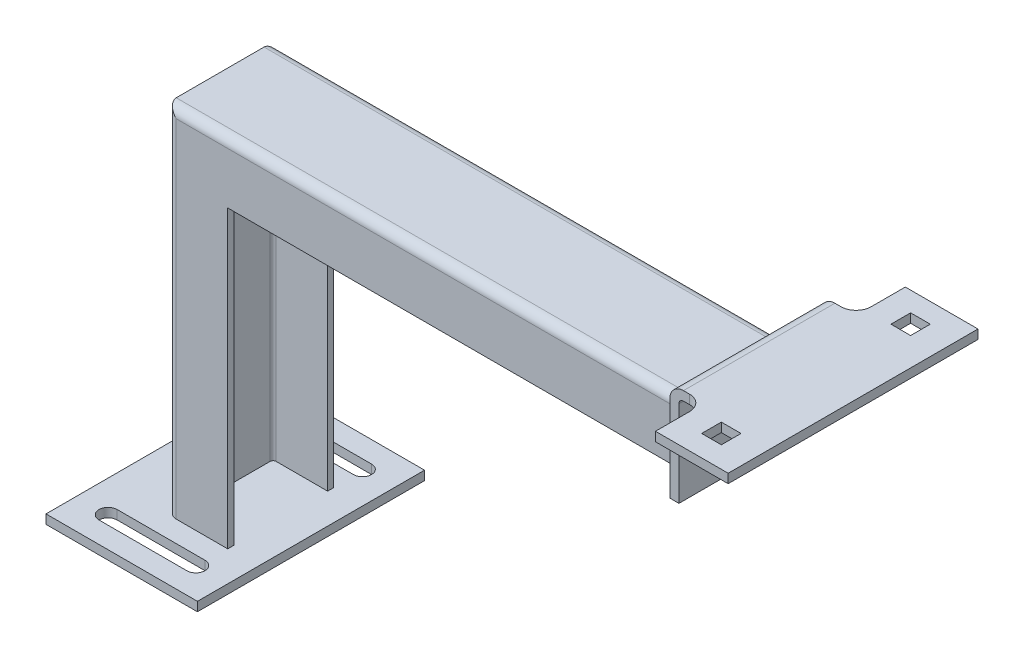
ISO-10303-21;
HEADER;
FILE_DESCRIPTION(('STEP AP214'),'2;1');
FILE_NAME('part.step','',(''),(''),'','','');
FILE_SCHEMA(('AUTOMOTIVE_DESIGN { 1 0 10303 214 1 1 1 1 }'));
ENDSEC;
DATA;
#1=APPLICATION_CONTEXT('core data for automotive mechanical design processes');
#2=APPLICATION_PROTOCOL_DEFINITION('international standard','automotive_design',2000,#1);
#3=PRODUCT_CONTEXT('',#1,'mechanical');
#4=PRODUCT('Part','Part','',(#3));
#5=PRODUCT_RELATED_PRODUCT_CATEGORY('part','',(#4));
#6=PRODUCT_DEFINITION_FORMATION('','',#4);
#7=PRODUCT_DEFINITION_CONTEXT('part definition',#1,'design');
#8=PRODUCT_DEFINITION('design','',#6,#7);
#9=PRODUCT_DEFINITION_SHAPE('','',#8);
#10=(LENGTH_UNIT() NAMED_UNIT(*) SI_UNIT(.MILLI.,.METRE.));
#11=(NAMED_UNIT(*) PLANE_ANGLE_UNIT() SI_UNIT($,.RADIAN.));
#12=(NAMED_UNIT(*) SI_UNIT($,.STERADIAN.) SOLID_ANGLE_UNIT());
#13=UNCERTAINTY_MEASURE_WITH_UNIT(LENGTH_MEASURE(1.E-05),#10,'distance_accuracy_value','');
#14=(GEOMETRIC_REPRESENTATION_CONTEXT(3) GLOBAL_UNCERTAINTY_ASSIGNED_CONTEXT((#13)) GLOBAL_UNIT_ASSIGNED_CONTEXT((#10,
#11,#12)) REPRESENTATION_CONTEXT('',''));
#15=CARTESIAN_POINT('',(0.,0.,0.));
#16=DIRECTION('',(0.,0.,1.));
#17=DIRECTION('',(1.,0.,0.));
#18=AXIS2_PLACEMENT_3D('',#15,#16,#17);
#19=CARTESIAN_POINT('',(-82.0010000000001,65.,0.));
#20=DIRECTION('',(0.,-1.,0.));
#21=DIRECTION('',(0.,0.,-1.));
#22=AXIS2_PLACEMENT_3D('',#19,#20,#21);
#23=PLANE('',#22);
#24=DIRECTION('',(0.,0.,1.));
#25=VECTOR('',#24,1.);
#26=CARTESIAN_POINT('',(-82.0010000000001,65.,0.));
#27=LINE('',#26,#25);
#28=CARTESIAN_POINT('',(-82.0010000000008,65.,66.));
#29=VERTEX_POINT('',#28);
#30=CARTESIAN_POINT('',(-82.0010000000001,65.,70.));
#31=VERTEX_POINT('',#30);
#32=EDGE_CURVE('E718',#29,#31,#27,.T.);
#33=ORIENTED_EDGE('',*,*,#32,.F.);
#34=DIRECTION('',(1.,0.,0.));
#35=VECTOR('',#34,1.);
#36=CARTESIAN_POINT('',(-82.0010000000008,65.,66.));
#37=LINE('',#36,#35);
#38=CARTESIAN_POINT('',(224.999,65.,66.));
#39=VERTEX_POINT('',#38);
#40=EDGE_CURVE('E671',#29,#39,#37,.T.);
#41=ORIENTED_EDGE('',*,*,#40,.T.);
#42=DIRECTION('',(0.,0.,1.));
#43=VECTOR('',#42,1.);
#44=CARTESIAN_POINT('',(224.999,65.,0.));
#45=LINE('',#44,#43);
#46=CARTESIAN_POINT('',(224.999,65.,70.));
#47=VERTEX_POINT('',#46);
#48=EDGE_CURVE('E714',#39,#47,#45,.T.);
#49=ORIENTED_EDGE('',*,*,#48,.T.);
#50=DIRECTION('',(1.,0.,0.));
#51=VECTOR('',#50,1.);
#52=CARTESIAN_POINT('',(-82.0010000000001,65.,70.));
#53=LINE('',#52,#51);
#54=EDGE_CURVE('E692',#31,#47,#53,.T.);
#55=ORIENTED_EDGE('',*,*,#54,.F.);
#56=EDGE_LOOP('',(#33,#41,#49,#55));
#57=FACE_BOUND('',#56,.T.);
#58=ADVANCED_FACE('F31',(#57),#23,.T.);
#59=CARTESIAN_POINT('',(-82.0010000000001,65.,0.));
#60=DIRECTION('',(1.,0.,0.));
#61=DIRECTION('',(0.,1.,0.));
#62=AXIS2_PLACEMENT_3D('',#59,#60,#61);
#63=PLANE('',#62);
#64=DIRECTION('',(0.,0.,1.));
#65=VECTOR('',#64,1.);
#66=CARTESIAN_POINT('',(-82.0010000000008,-130.,0.));
#67=LINE('',#66,#65);
#68=CARTESIAN_POINT('',(-82.0010000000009,-130.,66.));
#69=VERTEX_POINT('',#68);
#70=CARTESIAN_POINT('',(-82.0010000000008,-130.,70.));
#71=VERTEX_POINT('',#70);
#72=EDGE_CURVE('E722',#69,#71,#67,.T.);
#73=ORIENTED_EDGE('',*,*,#72,.F.);
#74=DIRECTION('',(0.,1.,0.));
#75=VECTOR('',#74,1.);
#76=CARTESIAN_POINT('',(-82.0010000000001,65.,66.));
#77=LINE('',#76,#75);
#78=EDGE_CURVE('E733',#69,#29,#77,.T.);
#79=ORIENTED_EDGE('',*,*,#78,.T.);
#80=ORIENTED_EDGE('',*,*,#32,.T.);
#81=DIRECTION('',(0.,1.,0.));
#82=VECTOR('',#81,1.);
#83=CARTESIAN_POINT('',(-82.0010000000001,65.,70.));
#84=LINE('',#83,#82);
#85=EDGE_CURVE('E689',#71,#31,#84,.T.);
#86=ORIENTED_EDGE('',*,*,#85,.F.);
#87=EDGE_LOOP('',(#73,#79,#80,#86));
#88=FACE_BOUND('',#87,.T.);
#89=ADVANCED_FACE('F861',(#88),#63,.T.);
#90=CARTESIAN_POINT('',(-225.,105.,70.));
#91=DIRECTION('',(0.,-1.,0.));
#92=DIRECTION('',(0.,0.,-1.));
#93=AXIS2_PLACEMENT_3D('',#90,#91,#92);
#94=PLANE('',#93);
#95=DIRECTION('',(0.,0.,1.));
#96=VECTOR('',#95,1.);
#97=CARTESIAN_POINT('',(-122.001,105.,0.));
#98=LINE('',#97,#96);
#99=CARTESIAN_POINT('',(-122.001,105.,6.));
#100=VERTEX_POINT('',#99);
#101=CARTESIAN_POINT('',(-122.001,105.,64.));
#102=VERTEX_POINT('',#101);
#103=EDGE_CURVE('E706',#100,#102,#98,.T.);
#104=ORIENTED_EDGE('',*,*,#103,.T.);
#105=DIRECTION('',(-1.,0.,0.));
#106=VECTOR('',#105,1.);
#107=CARTESIAN_POINT('',(224.999,105.,64.));
#108=LINE('',#107,#106);
#109=CARTESIAN_POINT('',(224.999,105.,64.));
#110=VERTEX_POINT('',#109);
#111=EDGE_CURVE('E754',#102,#110,#108,.F.);
#112=ORIENTED_EDGE('',*,*,#111,.T.);
#113=DIRECTION('',(0.,0.,1.));
#114=VECTOR('',#113,1.);
#115=CARTESIAN_POINT('',(224.999,105.,0.));
#116=LINE('',#115,#114);
#117=CARTESIAN_POINT('',(224.999,105.,6.00000000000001));
#118=VERTEX_POINT('',#117);
#119=EDGE_CURVE('E707',#118,#110,#116,.T.);
#120=ORIENTED_EDGE('',*,*,#119,.F.);
#121=DIRECTION('',(-1.,0.,0.));
#122=VECTOR('',#121,1.);
#123=CARTESIAN_POINT('',(-225.,105.,6.00000000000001));
#124=LINE('',#123,#122);
#125=EDGE_CURVE('E751',#118,#100,#124,.T.);
#126=ORIENTED_EDGE('',*,*,#125,.T.);
#127=EDGE_LOOP('',(#104,#112,#120,#126));
#128=FACE_BOUND('',#127,.T.);
#129=ADVANCED_FACE('F33',(#128),#94,.F.);
#130=CARTESIAN_POINT('',(-225.,-130.,70.));
#131=DIRECTION('',(0.,0.,1.));
#132=DIRECTION('',(1.,0.,0.));
#133=AXIS2_PLACEMENT_3D('',#130,#131,#132);
#134=PLANE('',#133);
#135=DIRECTION('',(0.,1.,0.));
#136=VECTOR('',#135,1.);
#137=CARTESIAN_POINT('',(224.999,105.,70.));
#138=LINE('',#137,#136);
#139=CARTESIAN_POINT('',(224.999,99.,70.));
#140=VERTEX_POINT('',#139);
#141=EDGE_CURVE('E695',#47,#140,#138,.T.);
#142=ORIENTED_EDGE('',*,*,#141,.T.);
#143=DIRECTION('',(-1.,0.,0.));
#144=VECTOR('',#143,1.);
#145=CARTESIAN_POINT('',(-122.001,99.,70.));
#146=LINE('',#145,#144);
#147=CARTESIAN_POINT('',(-116.001,99.,70.));
#148=VERTEX_POINT('',#147);
#149=EDGE_CURVE('E748',#140,#148,#146,.T.);
#150=ORIENTED_EDGE('',*,*,#149,.T.);
#151=DIRECTION('',(0.,-1.,0.));
#152=VECTOR('',#151,1.);
#153=CARTESIAN_POINT('',(-116.001000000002,-130.000000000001,70.));
#154=LINE('',#153,#152);
#155=CARTESIAN_POINT('',(-116.001000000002,-130.,70.));
#156=VERTEX_POINT('',#155);
#157=EDGE_CURVE('E739',#148,#156,#154,.T.);
#158=ORIENTED_EDGE('',*,*,#157,.T.);
#159=DIRECTION('',(1.,0.,0.));
#160=VECTOR('',#159,1.);
#161=CARTESIAN_POINT('',(-225.,-130.,70.));
#162=LINE('',#161,#160);
#163=EDGE_CURVE('E729',#156,#71,#162,.T.);
#164=ORIENTED_EDGE('',*,*,#163,.T.);
#165=ORIENTED_EDGE('',*,*,#85,.T.);
#166=ORIENTED_EDGE('',*,*,#54,.T.);
#167=EDGE_LOOP('',(#142,#150,#158,#164,#165,#166));
#168=FACE_BOUND('',#167,.T.);
#169=ADVANCED_FACE('F1081',(#168),#134,.T.);
#170=CARTESIAN_POINT('',(-225.,-130.,0.));
#171=DIRECTION('',(0.,0.,1.));
#172=DIRECTION('',(1.,0.,0.));
#173=AXIS2_PLACEMENT_3D('',#170,#171,#172);
#174=PLANE('',#173);
#175=DIRECTION('',(0.,-1.,0.));
#176=VECTOR('',#175,1.);
#177=CARTESIAN_POINT('',(-116.001,105.,0.));
#178=LINE('',#177,#176);
#179=CARTESIAN_POINT('',(-116.001000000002,-130.,0.));
#180=VERTEX_POINT('',#179);
#181=CARTESIAN_POINT('',(-116.001,99.,0.));
#182=VERTEX_POINT('',#181);
#183=EDGE_CURVE('E756',#180,#182,#178,.F.);
#184=ORIENTED_EDGE('',*,*,#183,.T.);
#185=DIRECTION('',(-1.,0.,0.));
#186=VECTOR('',#185,1.);
#187=CARTESIAN_POINT('',(-225.,99.,0.));
#188=LINE('',#187,#186);
#189=CARTESIAN_POINT('',(224.999,99.,0.));
#190=VERTEX_POINT('',#189);
#191=EDGE_CURVE('E758',#182,#190,#188,.F.);
#192=ORIENTED_EDGE('',*,*,#191,.T.);
#193=DIRECTION('',(0.,1.,0.));
#194=VECTOR('',#193,1.);
#195=CARTESIAN_POINT('',(224.999,105.,0.));
#196=LINE('',#195,#194);
#197=CARTESIAN_POINT('',(224.999,65.,0.));
#198=VERTEX_POINT('',#197);
#199=EDGE_CURVE('E703',#198,#190,#196,.T.);
#200=ORIENTED_EDGE('',*,*,#199,.F.);
#201=DIRECTION('',(1.,0.,0.));
#202=VECTOR('',#201,1.);
#203=CARTESIAN_POINT('',(-82.0010000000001,65.,0.));
#204=LINE('',#203,#202);
#205=CARTESIAN_POINT('',(-82.0010000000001,65.,0.));
#206=VERTEX_POINT('',#205);
#207=EDGE_CURVE('E701',#206,#198,#204,.T.);
#208=ORIENTED_EDGE('',*,*,#207,.F.);
#209=DIRECTION('',(0.,1.,0.));
#210=VECTOR('',#209,1.);
#211=CARTESIAN_POINT('',(-82.0010000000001,65.,0.));
#212=LINE('',#211,#210);
#213=CARTESIAN_POINT('',(-82.0010000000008,-130.,0.));
#214=VERTEX_POINT('',#213);
#215=EDGE_CURVE('E698',#214,#206,#212,.T.);
#216=ORIENTED_EDGE('',*,*,#215,.F.);
#217=DIRECTION('',(1.,0.,0.));
#218=VECTOR('',#217,1.);
#219=CARTESIAN_POINT('',(-225.,-130.,0.));
#220=LINE('',#219,#218);
#221=EDGE_CURVE('E710',#180,#214,#220,.T.);
#222=ORIENTED_EDGE('',*,*,#221,.F.);
#223=EDGE_LOOP('',(#184,#192,#200,#208,#216,#222));
#224=FACE_BOUND('',#223,.T.);
#225=ADVANCED_FACE('F882',(#224),#174,.F.);
#226=CARTESIAN_POINT('',(-122.001000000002,-130.,0.));
#227=DIRECTION('',(-1.,0.,0.));
#228=DIRECTION('',(0.,-1.,0.));
#229=AXIS2_PLACEMENT_3D('',#226,#227,#228);
#230=PLANE('',#229);
#231=ORIENTED_EDGE('',*,*,#103,.F.);
#232=DIRECTION('',(0.,-1.,0.));
#233=VECTOR('',#232,1.);
#234=CARTESIAN_POINT('',(-122.001000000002,-130.,6.));
#235=LINE('',#234,#233);
#236=CARTESIAN_POINT('',(-122.001000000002,-130.,6.));
#237=VERTEX_POINT('',#236);
#238=EDGE_CURVE('E762',#100,#237,#235,.T.);
#239=ORIENTED_EDGE('',*,*,#238,.T.);
#240=DIRECTION('',(0.,0.,1.));
#241=VECTOR('',#240,1.);
#242=CARTESIAN_POINT('',(-122.001000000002,-130.,0.));
#243=LINE('',#242,#241);
#244=CARTESIAN_POINT('',(-122.001000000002,-130.,64.));
#245=VERTEX_POINT('',#244);
#246=EDGE_CURVE('E723',#237,#245,#243,.T.);
#247=ORIENTED_EDGE('',*,*,#246,.T.);
#248=DIRECTION('',(0.,-1.,0.));
#249=VECTOR('',#248,1.);
#250=CARTESIAN_POINT('',(-122.001000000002,-130.,64.));
#251=LINE('',#250,#249);
#252=EDGE_CURVE('E760',#245,#102,#251,.F.);
#253=ORIENTED_EDGE('',*,*,#252,.T.);
#254=EDGE_LOOP('',(#231,#239,#247,#253));
#255=FACE_BOUND('',#254,.T.);
#256=ADVANCED_FACE('F874',(#255),#230,.T.);
#257=DIRECTION('',(1.,0.,0.));
#258=VECTOR('',#257,1.);
#259=CARTESIAN_POINT('',(-82.0010000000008,65.,4.));
#260=LINE('',#259,#258);
#261=CARTESIAN_POINT('',(-82.0010000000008,65.,4.));
#262=VERTEX_POINT('',#261);
#263=CARTESIAN_POINT('',(224.999,65.,4.));
#264=VERTEX_POINT('',#263);
#265=EDGE_CURVE('E666',#262,#264,#260,.T.);
#266=ORIENTED_EDGE('',*,*,#265,.F.);
#267=EDGE_CURVE('E715',#206,#262,#27,.T.);
#268=ORIENTED_EDGE('',*,*,#267,.F.);
#269=ORIENTED_EDGE('',*,*,#207,.T.);
#270=EDGE_CURVE('E711',#198,#264,#45,.T.);
#271=ORIENTED_EDGE('',*,*,#270,.T.);
#272=EDGE_LOOP('',(#266,#268,#269,#271));
#273=FACE_BOUND('',#272,.T.);
#274=ADVANCED_FACE('F864',(#273),#23,.T.);
#275=DIRECTION('',(0.,1.,0.));
#276=VECTOR('',#275,1.);
#277=CARTESIAN_POINT('',(-82.0010000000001,65.,4.));
#278=LINE('',#277,#276);
#279=CARTESIAN_POINT('',(-82.0010000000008,-130.,4.));
#280=VERTEX_POINT('',#279);
#281=EDGE_CURVE('E731',#280,#262,#278,.T.);
#282=ORIENTED_EDGE('',*,*,#281,.F.);
#283=EDGE_CURVE('E719',#214,#280,#67,.T.);
#284=ORIENTED_EDGE('',*,*,#283,.F.);
#285=ORIENTED_EDGE('',*,*,#215,.T.);
#286=ORIENTED_EDGE('',*,*,#267,.T.);
#287=EDGE_LOOP('',(#282,#284,#285,#286));
#288=FACE_BOUND('',#287,.T.);
#289=ADVANCED_FACE('F870',(#288),#63,.T.);
#290=CARTESIAN_POINT('',(-118.001000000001,101.,66.));
#291=DIRECTION('',(1.,0.,0.));
#292=DIRECTION('',(0.,1.,0.));
#293=AXIS2_PLACEMENT_3D('',#290,#291,#292);
#294=PLANE('',#293);
#295=DIRECTION('',(0.,0.,-1.));
#296=VECTOR('',#295,1.);
#297=CARTESIAN_POINT('',(-118.001000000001,-130.,70.));
#298=LINE('',#297,#296);
#299=CARTESIAN_POINT('',(-118.001000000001,-130.,64.));
#300=VERTEX_POINT('',#299);
#301=CARTESIAN_POINT('',(-118.001000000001,-130.,6.00000000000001));
#302=VERTEX_POINT('',#301);
#303=EDGE_CURVE('E736',#300,#302,#298,.T.);
#304=ORIENTED_EDGE('',*,*,#303,.T.);
#305=DIRECTION('',(0.,-1.,0.));
#306=VECTOR('',#305,1.);
#307=CARTESIAN_POINT('',(-118.001000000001,101.,6.));
#308=LINE('',#307,#306);
#309=CARTESIAN_POINT('',(-118.001000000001,101.,6.00000000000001));
#310=VERTEX_POINT('',#309);
#311=EDGE_CURVE('E792',#302,#310,#308,.F.);
#312=ORIENTED_EDGE('',*,*,#311,.T.);
#313=DIRECTION('',(0.,0.,-1.));
#314=VECTOR('',#313,1.);
#315=CARTESIAN_POINT('',(-118.001000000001,101.,66.));
#316=LINE('',#315,#314);
#317=CARTESIAN_POINT('',(-118.001000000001,101.,64.));
#318=VERTEX_POINT('',#317);
#319=EDGE_CURVE('E680',#318,#310,#316,.T.);
#320=ORIENTED_EDGE('',*,*,#319,.F.);
#321=DIRECTION('',(0.,-1.,0.));
#322=VECTOR('',#321,1.);
#323=CARTESIAN_POINT('',(-118.001000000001,-130.,64.));
#324=LINE('',#323,#322);
#325=EDGE_CURVE('E789',#318,#300,#324,.T.);
#326=ORIENTED_EDGE('',*,*,#325,.T.);
#327=EDGE_LOOP('',(#304,#312,#320,#326));
#328=FACE_BOUND('',#327,.T.);
#329=ADVANCED_FACE('F880',(#328),#294,.T.);
#330=CARTESIAN_POINT('',(224.999,101.,66.));
#331=DIRECTION('',(0.,0.,-1.));
#332=DIRECTION('',(-1.,0.,0.));
#333=AXIS2_PLACEMENT_3D('',#330,#331,#332);
#334=PLANE('',#333);
#335=DIRECTION('',(-1.,0.,0.));
#336=VECTOR('',#335,1.);
#337=CARTESIAN_POINT('',(-225.,-130.,66.));
#338=LINE('',#337,#336);
#339=CARTESIAN_POINT('',(-116.001000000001,-130.,66.));
#340=VERTEX_POINT('',#339);
#341=EDGE_CURVE('E686',#69,#340,#338,.T.);
#342=ORIENTED_EDGE('',*,*,#341,.T.);
#343=DIRECTION('',(0.,-1.,0.));
#344=VECTOR('',#343,1.);
#345=CARTESIAN_POINT('',(-116.001000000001,101.,66.));
#346=LINE('',#345,#344);
#347=CARTESIAN_POINT('',(-116.001000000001,99.,66.));
#348=VERTEX_POINT('',#347);
#349=EDGE_CURVE('E796',#340,#348,#346,.F.);
#350=ORIENTED_EDGE('',*,*,#349,.T.);
#351=DIRECTION('',(-1.,0.,0.));
#352=VECTOR('',#351,1.);
#353=CARTESIAN_POINT('',(224.999,99.,66.));
#354=LINE('',#353,#352);
#355=CARTESIAN_POINT('',(224.999,99.,66.));
#356=VERTEX_POINT('',#355);
#357=EDGE_CURVE('E794',#348,#356,#354,.F.);
#358=ORIENTED_EDGE('',*,*,#357,.T.);
#359=DIRECTION('',(0.,1.,0.));
#360=VECTOR('',#359,1.);
#361=CARTESIAN_POINT('',(224.999,101.,66.));
#362=LINE('',#361,#360);
#363=EDGE_CURVE('E674',#39,#356,#362,.T.);
#364=ORIENTED_EDGE('',*,*,#363,.F.);
#365=ORIENTED_EDGE('',*,*,#40,.F.);
#366=ORIENTED_EDGE('',*,*,#78,.F.);
#367=EDGE_LOOP('',(#342,#350,#358,#364,#365,#366));
#368=FACE_BOUND('',#367,.T.);
#369=ADVANCED_FACE('F1037',(#368),#334,.T.);
#370=CARTESIAN_POINT('',(224.999,101.,4.));
#371=DIRECTION('',(0.,0.,-1.));
#372=DIRECTION('',(-1.,0.,0.));
#373=AXIS2_PLACEMENT_3D('',#370,#371,#372);
#374=PLANE('',#373);
#375=DIRECTION('',(0.,1.,0.));
#376=VECTOR('',#375,1.);
#377=CARTESIAN_POINT('',(224.999,101.,4.));
#378=LINE('',#377,#376);
#379=CARTESIAN_POINT('',(224.999,99.,4.));
#380=VERTEX_POINT('',#379);
#381=EDGE_CURVE('E668',#264,#380,#378,.T.);
#382=ORIENTED_EDGE('',*,*,#381,.T.);
#383=DIRECTION('',(-1.,0.,0.));
#384=VECTOR('',#383,1.);
#385=CARTESIAN_POINT('',(224.999,99.,4.));
#386=LINE('',#385,#384);
#387=CARTESIAN_POINT('',(-116.001000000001,99.,4.));
#388=VERTEX_POINT('',#387);
#389=EDGE_CURVE('E774',#380,#388,#386,.T.);
#390=ORIENTED_EDGE('',*,*,#389,.T.);
#391=DIRECTION('',(0.,-1.,0.));
#392=VECTOR('',#391,1.);
#393=CARTESIAN_POINT('',(-116.001000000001,101.,4.));
#394=LINE('',#393,#392);
#395=CARTESIAN_POINT('',(-116.001000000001,-130.,4.));
#396=VERTEX_POINT('',#395);
#397=EDGE_CURVE('E772',#388,#396,#394,.T.);
#398=ORIENTED_EDGE('',*,*,#397,.T.);
#399=DIRECTION('',(-1.,0.,0.));
#400=VECTOR('',#399,1.);
#401=CARTESIAN_POINT('',(-225.,-130.,4.));
#402=LINE('',#401,#400);
#403=EDGE_CURVE('E683',#280,#396,#402,.T.);
#404=ORIENTED_EDGE('',*,*,#403,.F.);
#405=ORIENTED_EDGE('',*,*,#281,.T.);
#406=ORIENTED_EDGE('',*,*,#265,.T.);
#407=EDGE_LOOP('',(#382,#390,#398,#404,#405,#406));
#408=FACE_BOUND('',#407,.T.);
#409=ADVANCED_FACE('F902',(#408),#374,.F.);
#410=CARTESIAN_POINT('',(-118.001000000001,101.,66.));
#411=DIRECTION('',(0.,-1.,0.));
#412=DIRECTION('',(0.,0.,-1.));
#413=AXIS2_PLACEMENT_3D('',#410,#411,#412);
#414=PLANE('',#413);
#415=ORIENTED_EDGE('',*,*,#319,.T.);
#416=DIRECTION('',(-1.,0.,0.));
#417=VECTOR('',#416,1.);
#418=CARTESIAN_POINT('',(-118.001000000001,101.,6.));
#419=LINE('',#418,#417);
#420=CARTESIAN_POINT('',(224.999,101.,6.));
#421=VERTEX_POINT('',#420);
#422=EDGE_CURVE('E779',#310,#421,#419,.F.);
#423=ORIENTED_EDGE('',*,*,#422,.T.);
#424=DIRECTION('',(0.,0.,-1.));
#425=VECTOR('',#424,1.);
#426=CARTESIAN_POINT('',(224.999,101.,66.));
#427=LINE('',#426,#425);
#428=CARTESIAN_POINT('',(224.999,101.,64.));
#429=VERTEX_POINT('',#428);
#430=EDGE_CURVE('E677',#429,#421,#427,.T.);
#431=ORIENTED_EDGE('',*,*,#430,.F.);
#432=DIRECTION('',(-1.,0.,0.));
#433=VECTOR('',#432,1.);
#434=CARTESIAN_POINT('',(-118.001000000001,101.,64.));
#435=LINE('',#434,#433);
#436=EDGE_CURVE('E777',#429,#318,#435,.T.);
#437=ORIENTED_EDGE('',*,*,#436,.T.);
#438=EDGE_LOOP('',(#415,#423,#431,#437));
#439=FACE_BOUND('',#438,.T.);
#440=ADVANCED_FACE('F1019',(#439),#414,.T.);
#441=CARTESIAN_POINT('',(-162.001,-136.,-40.));
#442=DIRECTION('',(0.,-1.,0.));
#443=DIRECTION('',(0.,0.,-1.));
#444=AXIS2_PLACEMENT_3D('',#441,#442,#443);
#445=PLANE('',#444);
#446=DIRECTION('',(1.,0.,0.));
#447=VECTOR('',#446,1.);
#448=CARTESIAN_POINT('',(-141.001,-136.,84.));
#449=LINE('',#448,#447);
#450=CARTESIAN_POINT('',(-141.001,-136.,84.));
#451=VERTEX_POINT('',#450);
#452=CARTESIAN_POINT('',(-83.0010000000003,-136.,84.));
#453=VERTEX_POINT('',#452);
#454=EDGE_CURVE('E619',#451,#453,#449,.T.);
#455=ORIENTED_EDGE('',*,*,#454,.F.);
#456=CARTESIAN_POINT('',(-141.001,-136.,90.));
#457=DIRECTION('',(0.,-1.,0.));
#458=DIRECTION('',(1.,0.,0.));
#459=AXIS2_PLACEMENT_3D('',#456,#457,#458);
#460=CIRCLE('',#459,6.00000000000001);
#461=CARTESIAN_POINT('',(-141.001,-136.,96.));
#462=VERTEX_POINT('',#461);
#463=EDGE_CURVE('E617',#462,#451,#460,.T.);
#464=ORIENTED_EDGE('',*,*,#463,.F.);
#465=DIRECTION('',(-1.,0.,0.));
#466=VECTOR('',#465,1.);
#467=CARTESIAN_POINT('',(-141.001,-136.,96.));
#468=LINE('',#467,#466);
#469=CARTESIAN_POINT('',(-83.0010000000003,-136.,96.));
#470=VERTEX_POINT('',#469);
#471=EDGE_CURVE('E624',#470,#462,#468,.T.);
#472=ORIENTED_EDGE('',*,*,#471,.F.);
#473=CARTESIAN_POINT('',(-83.0010000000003,-136.,90.));
#474=DIRECTION('',(0.,-1.,0.));
#475=DIRECTION('',(1.,0.,0.));
#476=AXIS2_PLACEMENT_3D('',#473,#474,#475);
#477=CIRCLE('',#476,6.00000000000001);
#478=EDGE_CURVE('E621',#453,#470,#477,.T.);
#479=ORIENTED_EDGE('',*,*,#478,.F.);
#480=EDGE_LOOP('',(#455,#464,#472,#479));
#481=FACE_BOUND('',#480,.T.);
#482=DIRECTION('',(0.,0.,-1.));
#483=VECTOR('',#482,1.);
#484=CARTESIAN_POINT('',(-162.001,-136.,110.));
#485=LINE('',#484,#483);
#486=CARTESIAN_POINT('',(-162.001,-136.,110.));
#487=VERTEX_POINT('',#486);
#488=CARTESIAN_POINT('',(-162.001,-136.,-40.));
#489=VERTEX_POINT('',#488);
#490=EDGE_CURVE('E645',#487,#489,#485,.T.);
#491=ORIENTED_EDGE('',*,*,#490,.T.);
#492=DIRECTION('',(1.,0.,0.));
#493=VECTOR('',#492,1.);
#494=CARTESIAN_POINT('',(-162.001,-136.,-40.));
#495=LINE('',#494,#493);
#496=CARTESIAN_POINT('',(-62.0010000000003,-136.,-40.));
#497=VERTEX_POINT('',#496);
#498=EDGE_CURVE('E648',#489,#497,#495,.T.);
#499=ORIENTED_EDGE('',*,*,#498,.T.);
#500=DIRECTION('',(0.,0.,1.));
#501=VECTOR('',#500,1.);
#502=CARTESIAN_POINT('',(-62.0010000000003,-136.,110.));
#503=LINE('',#502,#501);
#504=CARTESIAN_POINT('',(-62.0010000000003,-136.,110.));
#505=VERTEX_POINT('',#504);
#506=EDGE_CURVE('E650',#497,#505,#503,.T.);
#507=ORIENTED_EDGE('',*,*,#506,.T.);
#508=DIRECTION('',(-1.,0.,0.));
#509=VECTOR('',#508,1.);
#510=CARTESIAN_POINT('',(-162.001,-136.,110.));
#511=LINE('',#510,#509);
#512=EDGE_CURVE('E652',#505,#487,#511,.T.);
#513=ORIENTED_EDGE('',*,*,#512,.T.);
#514=EDGE_LOOP('',(#491,#499,#507,#513));
#515=FACE_BOUND('',#514,.T.);
#516=DIRECTION('',(1.,0.,0.));
#517=VECTOR('',#516,1.);
#518=CARTESIAN_POINT('',(-141.001,-136.,-26.));
#519=LINE('',#518,#517);
#520=CARTESIAN_POINT('',(-141.001,-136.,-26.));
#521=VERTEX_POINT('',#520);
#522=CARTESIAN_POINT('',(-83.0010000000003,-136.,-26.));
#523=VERTEX_POINT('',#522);
#524=EDGE_CURVE('E588',#521,#523,#519,.T.);
#525=ORIENTED_EDGE('',*,*,#524,.F.);
#526=CARTESIAN_POINT('',(-141.001,-136.,-20.));
#527=DIRECTION('',(0.,-1.,0.));
#528=DIRECTION('',(1.,0.,0.));
#529=AXIS2_PLACEMENT_3D('',#526,#527,#528);
#530=CIRCLE('',#529,6.);
#531=CARTESIAN_POINT('',(-141.001,-136.,-14.));
#532=VERTEX_POINT('',#531);
#533=EDGE_CURVE('E586',#532,#521,#530,.T.);
#534=ORIENTED_EDGE('',*,*,#533,.F.);
#535=DIRECTION('',(-1.,0.,0.));
#536=VECTOR('',#535,1.);
#537=CARTESIAN_POINT('',(-141.001,-136.,-14.));
#538=LINE('',#537,#536);
#539=CARTESIAN_POINT('',(-83.0010000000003,-136.,-14.));
#540=VERTEX_POINT('',#539);
#541=EDGE_CURVE('E593',#540,#532,#538,.T.);
#542=ORIENTED_EDGE('',*,*,#541,.F.);
#543=CARTESIAN_POINT('',(-83.0010000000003,-136.,-20.));
#544=DIRECTION('',(0.,-1.,0.));
#545=DIRECTION('',(1.,0.,0.));
#546=AXIS2_PLACEMENT_3D('',#543,#544,#545);
#547=CIRCLE('',#546,6.);
#548=EDGE_CURVE('E590',#523,#540,#547,.T.);
#549=ORIENTED_EDGE('',*,*,#548,.F.);
#550=EDGE_LOOP('',(#525,#534,#542,#549));
#551=FACE_BOUND('',#550,.T.);
#552=ADVANCED_FACE('F1016',(#481,#515,#551),#445,.T.);
#553=CARTESIAN_POINT('',(-162.001,-130.,-40.));
#554=DIRECTION('',(0.,-1.,0.));
#555=DIRECTION('',(0.,0.,-1.));
#556=AXIS2_PLACEMENT_3D('',#553,#554,#555);
#557=PLANE('',#556);
#558=ORIENTED_EDGE('',*,*,#403,.T.);
#559=CARTESIAN_POINT('',(-116.001000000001,-130.,6.));
#560=DIRECTION('',(0.,-1.,0.));
#561=DIRECTION('',(0.,0.,-1.));
#562=AXIS2_PLACEMENT_3D('',#559,#560,#561);
#563=CIRCLE('',#562,2.);
#564=EDGE_CURVE('E787',#396,#302,#563,.F.);
#565=ORIENTED_EDGE('',*,*,#564,.T.);
#566=ORIENTED_EDGE('',*,*,#303,.F.);
#567=CARTESIAN_POINT('',(-116.001000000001,-130.,64.));
#568=DIRECTION('',(0.,-1.,0.));
#569=DIRECTION('',(0.,0.,-1.));
#570=AXIS2_PLACEMENT_3D('',#567,#568,#569);
#571=CIRCLE('',#570,2.);
#572=EDGE_CURVE('E785',#300,#340,#571,.F.);
#573=ORIENTED_EDGE('',*,*,#572,.T.);
#574=ORIENTED_EDGE('',*,*,#341,.F.);
#575=ORIENTED_EDGE('',*,*,#72,.T.);
#576=ORIENTED_EDGE('',*,*,#163,.F.);
#577=CARTESIAN_POINT('',(-116.001000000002,-130.,64.));
#578=DIRECTION('',(0.,-1.,0.));
#579=DIRECTION('',(0.,0.,-1.));
#580=AXIS2_PLACEMENT_3D('',#577,#578,#579);
#581=CIRCLE('',#580,6.);
#582=EDGE_CURVE('E770',#156,#245,#581,.T.);
#583=ORIENTED_EDGE('',*,*,#582,.T.);
#584=ORIENTED_EDGE('',*,*,#246,.F.);
#585=CARTESIAN_POINT('',(-116.001000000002,-130.,6.));
#586=DIRECTION('',(0.,-1.,0.));
#587=DIRECTION('',(0.,0.,-1.));
#588=AXIS2_PLACEMENT_3D('',#585,#586,#587);
#589=CIRCLE('',#588,6.);
#590=EDGE_CURVE('E768',#237,#180,#589,.T.);
#591=ORIENTED_EDGE('',*,*,#590,.T.);
#592=ORIENTED_EDGE('',*,*,#221,.T.);
#593=ORIENTED_EDGE('',*,*,#283,.T.);
#594=EDGE_LOOP('',(#558,#565,#566,#573,#574,#575,#576,#583,#584,#591,#592,#593));
#595=FACE_BOUND('',#594,.T.);
#596=CARTESIAN_POINT('',(-141.001,-130.,90.));
#597=DIRECTION('',(0.,-1.,0.));
#598=DIRECTION('',(1.,0.,0.));
#599=AXIS2_PLACEMENT_3D('',#596,#597,#598);
#600=CIRCLE('',#599,6.00000000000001);
#601=CARTESIAN_POINT('',(-141.001,-130.,96.));
#602=VERTEX_POINT('',#601);
#603=CARTESIAN_POINT('',(-141.001,-130.,84.));
#604=VERTEX_POINT('',#603);
#605=EDGE_CURVE('E605',#602,#604,#600,.T.);
#606=ORIENTED_EDGE('',*,*,#605,.T.);
#607=DIRECTION('',(1.,0.,0.));
#608=VECTOR('',#607,1.);
#609=CARTESIAN_POINT('',(-141.001,-130.,84.));
#610=LINE('',#609,#608);
#611=CARTESIAN_POINT('',(-83.0010000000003,-130.,84.));
#612=VERTEX_POINT('',#611);
#613=EDGE_CURVE('E608',#604,#612,#610,.T.);
#614=ORIENTED_EDGE('',*,*,#613,.T.);
#615=CARTESIAN_POINT('',(-83.0010000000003,-130.,90.));
#616=DIRECTION('',(0.,-1.,0.));
#617=DIRECTION('',(1.,0.,0.));
#618=AXIS2_PLACEMENT_3D('',#615,#616,#617);
#619=CIRCLE('',#618,6.00000000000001);
#620=CARTESIAN_POINT('',(-83.0010000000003,-130.,96.));
#621=VERTEX_POINT('',#620);
#622=EDGE_CURVE('E611',#612,#621,#619,.T.);
#623=ORIENTED_EDGE('',*,*,#622,.T.);
#624=DIRECTION('',(-1.,0.,0.));
#625=VECTOR('',#624,1.);
#626=CARTESIAN_POINT('',(-141.001,-130.,96.));
#627=LINE('',#626,#625);
#628=EDGE_CURVE('E614',#621,#602,#627,.T.);
#629=ORIENTED_EDGE('',*,*,#628,.T.);
#630=EDGE_LOOP('',(#606,#614,#623,#629));
#631=FACE_BOUND('',#630,.T.);
#632=DIRECTION('',(0.,0.,-1.));
#633=VECTOR('',#632,1.);
#634=CARTESIAN_POINT('',(-162.001,-130.,110.));
#635=LINE('',#634,#633);
#636=CARTESIAN_POINT('',(-162.001,-130.,110.));
#637=VERTEX_POINT('',#636);
#638=CARTESIAN_POINT('',(-162.001,-130.,-40.));
#639=VERTEX_POINT('',#638);
#640=EDGE_CURVE('E636',#637,#639,#635,.T.);
#641=ORIENTED_EDGE('',*,*,#640,.F.);
#642=DIRECTION('',(-1.,0.,0.));
#643=VECTOR('',#642,1.);
#644=CARTESIAN_POINT('',(-162.001,-130.,110.));
#645=LINE('',#644,#643);
#646=CARTESIAN_POINT('',(-62.0010000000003,-130.,110.));
#647=VERTEX_POINT('',#646);
#648=EDGE_CURVE('E643',#647,#637,#645,.T.);
#649=ORIENTED_EDGE('',*,*,#648,.F.);
#650=DIRECTION('',(0.,0.,1.));
#651=VECTOR('',#650,1.);
#652=CARTESIAN_POINT('',(-62.0010000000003,-130.,110.));
#653=LINE('',#652,#651);
#654=CARTESIAN_POINT('',(-62.0010000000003,-130.,-40.));
#655=VERTEX_POINT('',#654);
#656=EDGE_CURVE('E641',#655,#647,#653,.T.);
#657=ORIENTED_EDGE('',*,*,#656,.F.);
#658=DIRECTION('',(1.,0.,0.));
#659=VECTOR('',#658,1.);
#660=CARTESIAN_POINT('',(-162.001,-130.,-40.));
#661=LINE('',#660,#659);
#662=EDGE_CURVE('E639',#639,#655,#661,.T.);
#663=ORIENTED_EDGE('',*,*,#662,.F.);
#664=EDGE_LOOP('',(#641,#649,#657,#663));
#665=FACE_BOUND('',#664,.T.);
#666=CARTESIAN_POINT('',(-141.001,-130.,-20.));
#667=DIRECTION('',(0.,-1.,0.));
#668=DIRECTION('',(1.,0.,0.));
#669=AXIS2_PLACEMENT_3D('',#666,#667,#668);
#670=CIRCLE('',#669,6.);
#671=CARTESIAN_POINT('',(-141.001,-130.,-14.));
#672=VERTEX_POINT('',#671);
#673=CARTESIAN_POINT('',(-141.001,-130.,-26.));
#674=VERTEX_POINT('',#673);
#675=EDGE_CURVE('E574',#672,#674,#670,.T.);
#676=ORIENTED_EDGE('',*,*,#675,.T.);
#677=DIRECTION('',(1.,0.,0.));
#678=VECTOR('',#677,1.);
#679=CARTESIAN_POINT('',(-141.001,-130.,-26.));
#680=LINE('',#679,#678);
#681=CARTESIAN_POINT('',(-83.0010000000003,-130.,-26.));
#682=VERTEX_POINT('',#681);
#683=EDGE_CURVE('E577',#674,#682,#680,.T.);
#684=ORIENTED_EDGE('',*,*,#683,.T.);
#685=CARTESIAN_POINT('',(-83.0010000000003,-130.,-20.));
#686=DIRECTION('',(0.,-1.,0.));
#687=DIRECTION('',(1.,0.,0.));
#688=AXIS2_PLACEMENT_3D('',#685,#686,#687);
#689=CIRCLE('',#688,6.);
#690=CARTESIAN_POINT('',(-83.0010000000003,-130.,-14.));
#691=VERTEX_POINT('',#690);
#692=EDGE_CURVE('E580',#682,#691,#689,.T.);
#693=ORIENTED_EDGE('',*,*,#692,.T.);
#694=DIRECTION('',(-1.,0.,0.));
#695=VECTOR('',#694,1.);
#696=CARTESIAN_POINT('',(-141.001,-130.,-14.));
#697=LINE('',#696,#695);
#698=EDGE_CURVE('E583',#691,#672,#697,.T.);
#699=ORIENTED_EDGE('',*,*,#698,.T.);
#700=EDGE_LOOP('',(#676,#684,#693,#699));
#701=FACE_BOUND('',#700,.T.);
#702=ADVANCED_FACE('F917',(#595,#631,#665,#701),#557,.F.);
#703=CARTESIAN_POINT('',(-162.001,-136.,110.));
#704=DIRECTION('',(1.,0.,0.));
#705=DIRECTION('',(0.,0.,-1.));
#706=AXIS2_PLACEMENT_3D('',#703,#704,#705);
#707=PLANE('',#706);
#708=ORIENTED_EDGE('',*,*,#640,.T.);
#709=DIRECTION('',(0.,1.,0.));
#710=VECTOR('',#709,1.);
#711=CARTESIAN_POINT('',(-162.001,-136.,-40.));
#712=LINE('',#711,#710);
#713=EDGE_CURVE('E663',#489,#639,#712,.T.);
#714=ORIENTED_EDGE('',*,*,#713,.F.);
#715=ORIENTED_EDGE('',*,*,#490,.F.);
#716=DIRECTION('',(0.,1.,0.));
#717=VECTOR('',#716,1.);
#718=CARTESIAN_POINT('',(-162.001,-136.,110.));
#719=LINE('',#718,#717);
#720=EDGE_CURVE('E654',#487,#637,#719,.T.);
#721=ORIENTED_EDGE('',*,*,#720,.T.);
#722=EDGE_LOOP('',(#708,#714,#715,#721));
#723=FACE_BOUND('',#722,.T.);
#724=ADVANCED_FACE('F1015',(#723),#707,.F.);
#725=CARTESIAN_POINT('',(-162.001,-136.,-40.));
#726=DIRECTION('',(0.,0.,1.));
#727=DIRECTION('',(1.,0.,0.));
#728=AXIS2_PLACEMENT_3D('',#725,#726,#727);
#729=PLANE('',#728);
#730=ORIENTED_EDGE('',*,*,#662,.T.);
#731=DIRECTION('',(0.,1.,0.));
#732=VECTOR('',#731,1.);
#733=CARTESIAN_POINT('',(-62.0010000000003,-136.,-40.));
#734=LINE('',#733,#732);
#735=EDGE_CURVE('E660',#497,#655,#734,.T.);
#736=ORIENTED_EDGE('',*,*,#735,.F.);
#737=ORIENTED_EDGE('',*,*,#498,.F.);
#738=ORIENTED_EDGE('',*,*,#713,.T.);
#739=EDGE_LOOP('',(#730,#736,#737,#738));
#740=FACE_BOUND('',#739,.T.);
#741=ADVANCED_FACE('F1027',(#740),#729,.F.);
#742=CARTESIAN_POINT('',(-62.0010000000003,-136.,110.));
#743=DIRECTION('',(-1.,0.,0.));
#744=DIRECTION('',(0.,0.,1.));
#745=AXIS2_PLACEMENT_3D('',#742,#743,#744);
#746=PLANE('',#745);
#747=ORIENTED_EDGE('',*,*,#656,.T.);
#748=DIRECTION('',(0.,1.,0.));
#749=VECTOR('',#748,1.);
#750=CARTESIAN_POINT('',(-62.0010000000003,-136.,110.));
#751=LINE('',#750,#749);
#752=EDGE_CURVE('E657',#505,#647,#751,.T.);
#753=ORIENTED_EDGE('',*,*,#752,.F.);
#754=ORIENTED_EDGE('',*,*,#506,.F.);
#755=ORIENTED_EDGE('',*,*,#735,.T.);
#756=EDGE_LOOP('',(#747,#753,#754,#755));
#757=FACE_BOUND('',#756,.T.);
#758=ADVANCED_FACE('F1023',(#757),#746,.F.);
#759=CARTESIAN_POINT('',(-162.001,-136.,110.));
#760=DIRECTION('',(0.,0.,-1.));
#761=DIRECTION('',(-1.,0.,0.));
#762=AXIS2_PLACEMENT_3D('',#759,#760,#761);
#763=PLANE('',#762);
#764=ORIENTED_EDGE('',*,*,#648,.T.);
#765=ORIENTED_EDGE('',*,*,#720,.F.);
#766=ORIENTED_EDGE('',*,*,#512,.F.);
#767=ORIENTED_EDGE('',*,*,#752,.T.);
#768=EDGE_LOOP('',(#764,#765,#766,#767));
#769=FACE_BOUND('',#768,.T.);
#770=ADVANCED_FACE('F1011',(#769),#763,.F.);
#771=CARTESIAN_POINT('',(-141.001,-136.,90.));
#772=DIRECTION('',(0.,1.,0.));
#773=DIRECTION('',(-1.,0.,0.));
#774=AXIS2_PLACEMENT_3D('',#771,#772,#773);
#775=CYLINDRICAL_SURFACE('',#774,6.00000000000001);
#776=ORIENTED_EDGE('',*,*,#605,.F.);
#777=DIRECTION('',(0.,1.,0.));
#778=VECTOR('',#777,1.);
#779=CARTESIAN_POINT('',(-141.001,-136.,96.));
#780=LINE('',#779,#778);
#781=EDGE_CURVE('E626',#462,#602,#780,.T.);
#782=ORIENTED_EDGE('',*,*,#781,.F.);
#783=ORIENTED_EDGE('',*,*,#463,.T.);
#784=DIRECTION('',(0.,1.,0.));
#785=VECTOR('',#784,1.);
#786=CARTESIAN_POINT('',(-141.001,-136.,84.));
#787=LINE('',#786,#785);
#788=EDGE_CURVE('E633',#451,#604,#787,.T.);
#789=ORIENTED_EDGE('',*,*,#788,.T.);
#790=EDGE_LOOP('',(#776,#782,#783,#789));
#791=FACE_BOUND('',#790,.T.);
#792=ADVANCED_FACE('F1007',(#791),#775,.F.);
#793=CARTESIAN_POINT('',(-141.001,-136.,84.));
#794=DIRECTION('',(0.,0.,1.));
#795=DIRECTION('',(1.,0.,0.));
#796=AXIS2_PLACEMENT_3D('',#793,#794,#795);
#797=PLANE('',#796);
#798=ORIENTED_EDGE('',*,*,#613,.F.);
#799=ORIENTED_EDGE('',*,*,#788,.F.);
#800=ORIENTED_EDGE('',*,*,#454,.T.);
#801=DIRECTION('',(0.,1.,0.));
#802=VECTOR('',#801,1.);
#803=CARTESIAN_POINT('',(-83.0010000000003,-136.,84.));
#804=LINE('',#803,#802);
#805=EDGE_CURVE('E631',#453,#612,#804,.T.);
#806=ORIENTED_EDGE('',*,*,#805,.T.);
#807=EDGE_LOOP('',(#798,#799,#800,#806));
#808=FACE_BOUND('',#807,.T.);
#809=ADVANCED_FACE('F1003',(#808),#797,.T.);
#810=CARTESIAN_POINT('',(-83.0010000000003,-136.,90.));
#811=DIRECTION('',(0.,1.,0.));
#812=DIRECTION('',(-1.,0.,0.));
#813=AXIS2_PLACEMENT_3D('',#810,#811,#812);
#814=CYLINDRICAL_SURFACE('',#813,6.00000000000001);
#815=ORIENTED_EDGE('',*,*,#622,.F.);
#816=ORIENTED_EDGE('',*,*,#805,.F.);
#817=ORIENTED_EDGE('',*,*,#478,.T.);
#818=DIRECTION('',(0.,1.,0.));
#819=VECTOR('',#818,1.);
#820=CARTESIAN_POINT('',(-83.0010000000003,-136.,96.));
#821=LINE('',#820,#819);
#822=EDGE_CURVE('E629',#470,#621,#821,.T.);
#823=ORIENTED_EDGE('',*,*,#822,.T.);
#824=EDGE_LOOP('',(#815,#816,#817,#823));
#825=FACE_BOUND('',#824,.T.);
#826=ADVANCED_FACE('F999',(#825),#814,.F.);
#827=CARTESIAN_POINT('',(-141.001,-136.,96.));
#828=DIRECTION('',(0.,0.,-1.));
#829=DIRECTION('',(-1.,0.,0.));
#830=AXIS2_PLACEMENT_3D('',#827,#828,#829);
#831=PLANE('',#830);
#832=ORIENTED_EDGE('',*,*,#628,.F.);
#833=ORIENTED_EDGE('',*,*,#822,.F.);
#834=ORIENTED_EDGE('',*,*,#471,.T.);
#835=ORIENTED_EDGE('',*,*,#781,.T.);
#836=EDGE_LOOP('',(#832,#833,#834,#835));
#837=FACE_BOUND('',#836,.T.);
#838=ADVANCED_FACE('F995',(#837),#831,.T.);
#839=CARTESIAN_POINT('',(-141.001,-136.,-20.));
#840=DIRECTION('',(0.,1.,0.));
#841=DIRECTION('',(-1.,0.,0.));
#842=AXIS2_PLACEMENT_3D('',#839,#840,#841);
#843=CYLINDRICAL_SURFACE('',#842,6.);
#844=ORIENTED_EDGE('',*,*,#675,.F.);
#845=DIRECTION('',(0.,1.,0.));
#846=VECTOR('',#845,1.);
#847=CARTESIAN_POINT('',(-141.001,-136.,-14.));
#848=LINE('',#847,#846);
#849=EDGE_CURVE('E595',#532,#672,#848,.T.);
#850=ORIENTED_EDGE('',*,*,#849,.F.);
#851=ORIENTED_EDGE('',*,*,#533,.T.);
#852=DIRECTION('',(0.,1.,0.));
#853=VECTOR('',#852,1.);
#854=CARTESIAN_POINT('',(-141.001,-136.,-26.));
#855=LINE('',#854,#853);
#856=EDGE_CURVE('E602',#521,#674,#855,.T.);
#857=ORIENTED_EDGE('',*,*,#856,.T.);
#858=EDGE_LOOP('',(#844,#850,#851,#857));
#859=FACE_BOUND('',#858,.T.);
#860=ADVANCED_FACE('F991',(#859),#843,.F.);
#861=CARTESIAN_POINT('',(-141.001,-136.,-26.));
#862=DIRECTION('',(0.,0.,1.));
#863=DIRECTION('',(1.,0.,0.));
#864=AXIS2_PLACEMENT_3D('',#861,#862,#863);
#865=PLANE('',#864);
#866=ORIENTED_EDGE('',*,*,#683,.F.);
#867=ORIENTED_EDGE('',*,*,#856,.F.);
#868=ORIENTED_EDGE('',*,*,#524,.T.);
#869=DIRECTION('',(0.,1.,0.));
#870=VECTOR('',#869,1.);
#871=CARTESIAN_POINT('',(-83.0010000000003,-136.,-26.));
#872=LINE('',#871,#870);
#873=EDGE_CURVE('E600',#523,#682,#872,.T.);
#874=ORIENTED_EDGE('',*,*,#873,.T.);
#875=EDGE_LOOP('',(#866,#867,#868,#874));
#876=FACE_BOUND('',#875,.T.);
#877=ADVANCED_FACE('F987',(#876),#865,.T.);
#878=CARTESIAN_POINT('',(-83.0010000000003,-136.,-20.));
#879=DIRECTION('',(0.,1.,0.));
#880=DIRECTION('',(-1.,0.,0.));
#881=AXIS2_PLACEMENT_3D('',#878,#879,#880);
#882=CYLINDRICAL_SURFACE('',#881,6.);
#883=ORIENTED_EDGE('',*,*,#692,.F.);
#884=ORIENTED_EDGE('',*,*,#873,.F.);
#885=ORIENTED_EDGE('',*,*,#548,.T.);
#886=DIRECTION('',(0.,1.,0.));
#887=VECTOR('',#886,1.);
#888=CARTESIAN_POINT('',(-83.0010000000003,-136.,-14.));
#889=LINE('',#888,#887);
#890=EDGE_CURVE('E598',#540,#691,#889,.T.);
#891=ORIENTED_EDGE('',*,*,#890,.T.);
#892=EDGE_LOOP('',(#883,#884,#885,#891));
#893=FACE_BOUND('',#892,.T.);
#894=ADVANCED_FACE('F983',(#893),#882,.F.);
#895=CARTESIAN_POINT('',(-141.001,-136.,-14.));
#896=DIRECTION('',(0.,0.,-1.));
#897=DIRECTION('',(-1.,0.,0.));
#898=AXIS2_PLACEMENT_3D('',#895,#896,#897);
#899=PLANE('',#898);
#900=ORIENTED_EDGE('',*,*,#698,.F.);
#901=ORIENTED_EDGE('',*,*,#890,.F.);
#902=ORIENTED_EDGE('',*,*,#541,.T.);
#903=ORIENTED_EDGE('',*,*,#849,.T.);
#904=EDGE_LOOP('',(#900,#901,#902,#903));
#905=FACE_BOUND('',#904,.T.);
#906=ADVANCED_FACE('F980',(#905),#899,.T.);
#907=CARTESIAN_POINT('',(230.999,60.,85.));
#908=DIRECTION('',(1.,0.,0.));
#909=DIRECTION('',(0.,0.,-1.));
#910=AXIS2_PLACEMENT_3D('',#907,#908,#909);
#911=PLANE('',#910);
#912=DIRECTION('',(0.,1.,0.));
#913=VECTOR('',#912,1.);
#914=CARTESIAN_POINT('',(230.999,126.,-15.));
#915=LINE('',#914,#913);
#916=CARTESIAN_POINT('',(230.999,60.,-15.));
#917=VERTEX_POINT('',#916);
#918=CARTESIAN_POINT('',(230.999,117.,-15.));
#919=VERTEX_POINT('',#918);
#920=EDGE_CURVE('E563',#917,#919,#915,.T.);
#921=ORIENTED_EDGE('',*,*,#920,.T.);
#922=DIRECTION('',(0.,0.,-1.));
#923=VECTOR('',#922,1.);
#924=CARTESIAN_POINT('',(230.999,117.,85.));
#925=LINE('',#924,#923);
#926=CARTESIAN_POINT('',(230.999,117.,85.));
#927=VERTEX_POINT('',#926);
#928=EDGE_CURVE('E801',#919,#927,#925,.F.);
#929=ORIENTED_EDGE('',*,*,#928,.T.);
#930=DIRECTION('',(0.,-1.,0.));
#931=VECTOR('',#930,1.);
#932=CARTESIAN_POINT('',(230.999,126.,85.));
#933=LINE('',#932,#931);
#934=CARTESIAN_POINT('',(230.999,60.,85.));
#935=VERTEX_POINT('',#934);
#936=EDGE_CURVE('E559',#927,#935,#933,.T.);
#937=ORIENTED_EDGE('',*,*,#936,.T.);
#938=DIRECTION('',(0.,0.,-1.));
#939=VECTOR('',#938,1.);
#940=CARTESIAN_POINT('',(230.999,60.,85.));
#941=LINE('',#940,#939);
#942=EDGE_CURVE('E561',#935,#917,#941,.T.);
#943=ORIENTED_EDGE('',*,*,#942,.T.);
#944=EDGE_LOOP('',(#921,#929,#937,#943));
#945=FACE_BOUND('',#944,.T.);
#946=DIRECTION('',(0.,0.,-1.));
#947=VECTOR('',#946,1.);
#948=CARTESIAN_POINT('',(230.999,79.,42.));
#949=LINE('',#948,#947);
#950=CARTESIAN_POINT('',(230.999,79.,42.));
#951=VERTEX_POINT('',#950);
#952=CARTESIAN_POINT('',(230.999,79.,29.));
#953=VERTEX_POINT('',#952);
#954=EDGE_CURVE('E536',#951,#953,#949,.T.);
#955=ORIENTED_EDGE('',*,*,#954,.F.);
#956=DIRECTION('',(0.,-1.,0.));
#957=VECTOR('',#956,1.);
#958=CARTESIAN_POINT('',(230.999,92.,42.));
#959=LINE('',#958,#957);
#960=CARTESIAN_POINT('',(230.999,92.,42.));
#961=VERTEX_POINT('',#960);
#962=EDGE_CURVE('E534',#961,#951,#959,.T.);
#963=ORIENTED_EDGE('',*,*,#962,.F.);
#964=DIRECTION('',(0.,0.,1.));
#965=VECTOR('',#964,1.);
#966=CARTESIAN_POINT('',(230.999,92.,42.));
#967=LINE('',#966,#965);
#968=CARTESIAN_POINT('',(230.999,92.,29.));
#969=VERTEX_POINT('',#968);
#970=EDGE_CURVE('E541',#969,#961,#967,.T.);
#971=ORIENTED_EDGE('',*,*,#970,.F.);
#972=DIRECTION('',(0.,1.,0.));
#973=VECTOR('',#972,1.);
#974=CARTESIAN_POINT('',(230.999,92.,29.));
#975=LINE('',#974,#973);
#976=EDGE_CURVE('E538',#953,#969,#975,.T.);
#977=ORIENTED_EDGE('',*,*,#976,.F.);
#978=EDGE_LOOP('',(#955,#963,#971,#977));
#979=FACE_BOUND('',#978,.T.);
#980=ADVANCED_FACE('F972',(#945,#979),#911,.T.);
#981=CARTESIAN_POINT('',(224.999,60.,85.));
#982=DIRECTION('',(1.,0.,0.));
#983=DIRECTION('',(0.,0.,-1.));
#984=AXIS2_PLACEMENT_3D('',#981,#982,#983);
#985=PLANE('',#984);
#986=ORIENTED_EDGE('',*,*,#430,.T.);
#987=CARTESIAN_POINT('',(224.999,99.,6.));
#988=DIRECTION('',(1.,0.,0.));
#989=DIRECTION('',(0.,0.,-1.));
#990=AXIS2_PLACEMENT_3D('',#987,#988,#989);
#991=CIRCLE('',#990,2.);
#992=EDGE_CURVE('E783',#421,#380,#991,.F.);
#993=ORIENTED_EDGE('',*,*,#992,.T.);
#994=ORIENTED_EDGE('',*,*,#381,.F.);
#995=ORIENTED_EDGE('',*,*,#270,.F.);
#996=ORIENTED_EDGE('',*,*,#199,.T.);
#997=CARTESIAN_POINT('',(224.999,99.,6.00000000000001));
#998=DIRECTION('',(1.,0.,0.));
#999=DIRECTION('',(0.,0.,-1.));
#1000=AXIS2_PLACEMENT_3D('',#997,#998,#999);
#1001=CIRCLE('',#1000,6.);
#1002=EDGE_CURVE('E766',#190,#118,#1001,.T.);
#1003=ORIENTED_EDGE('',*,*,#1002,.T.);
#1004=ORIENTED_EDGE('',*,*,#119,.T.);
#1005=CARTESIAN_POINT('',(224.999,99.,64.));
#1006=DIRECTION('',(1.,0.,0.));
#1007=DIRECTION('',(0.,0.,-1.));
#1008=AXIS2_PLACEMENT_3D('',#1005,#1006,#1007);
#1009=CIRCLE('',#1008,6.);
#1010=EDGE_CURVE('E764',#110,#140,#1009,.T.);
#1011=ORIENTED_EDGE('',*,*,#1010,.T.);
#1012=ORIENTED_EDGE('',*,*,#141,.F.);
#1013=ORIENTED_EDGE('',*,*,#48,.F.);
#1014=ORIENTED_EDGE('',*,*,#363,.T.);
#1015=CARTESIAN_POINT('',(224.999,99.,64.));
#1016=DIRECTION('',(1.,0.,0.));
#1017=DIRECTION('',(0.,0.,-1.));
#1018=AXIS2_PLACEMENT_3D('',#1015,#1016,#1017);
#1019=CIRCLE('',#1018,2.);
#1020=EDGE_CURVE('E781',#356,#429,#1019,.F.);
#1021=ORIENTED_EDGE('',*,*,#1020,.T.);
#1022=EDGE_LOOP('',(#986,#993,#994,#995,#996,#1003,#1004,#1011,#1012,#1013,#1014,#1021));
#1023=FACE_BOUND('',#1022,.T.);
#1024=DIRECTION('',(0.,-1.,0.));
#1025=VECTOR('',#1024,1.);
#1026=CARTESIAN_POINT('',(224.999,126.,85.));
#1027=LINE('',#1026,#1025);
#1028=CARTESIAN_POINT('',(224.999,117.,85.));
#1029=VERTEX_POINT('',#1028);
#1030=CARTESIAN_POINT('',(224.999,60.,85.));
#1031=VERTEX_POINT('',#1030);
#1032=EDGE_CURVE('E553',#1029,#1031,#1027,.T.);
#1033=ORIENTED_EDGE('',*,*,#1032,.F.);
#1034=DIRECTION('',(0.,0.,1.));
#1035=VECTOR('',#1034,1.);
#1036=CARTESIAN_POINT('',(224.999,117.,85.));
#1037=LINE('',#1036,#1035);
#1038=CARTESIAN_POINT('',(224.999,117.,-15.));
#1039=VERTEX_POINT('',#1038);
#1040=EDGE_CURVE('E39',#1029,#1039,#1037,.F.);
#1041=ORIENTED_EDGE('',*,*,#1040,.T.);
#1042=DIRECTION('',(0.,1.,0.));
#1043=VECTOR('',#1042,1.);
#1044=CARTESIAN_POINT('',(224.999,126.,-15.));
#1045=LINE('',#1044,#1043);
#1046=CARTESIAN_POINT('',(224.999,60.,-15.));
#1047=VERTEX_POINT('',#1046);
#1048=EDGE_CURVE('E557',#1047,#1039,#1045,.T.);
#1049=ORIENTED_EDGE('',*,*,#1048,.F.);
#1050=DIRECTION('',(0.,0.,-1.));
#1051=VECTOR('',#1050,1.);
#1052=CARTESIAN_POINT('',(224.999,60.,85.));
#1053=LINE('',#1052,#1051);
#1054=EDGE_CURVE('E555',#1031,#1047,#1053,.T.);
#1055=ORIENTED_EDGE('',*,*,#1054,.F.);
#1056=EDGE_LOOP('',(#1033,#1041,#1049,#1055));
#1057=FACE_BOUND('',#1056,.T.);
#1058=DIRECTION('',(0.,-1.,0.));
#1059=VECTOR('',#1058,1.);
#1060=CARTESIAN_POINT('',(224.999,92.,42.));
#1061=LINE('',#1060,#1059);
#1062=CARTESIAN_POINT('',(224.999,92.,42.));
#1063=VERTEX_POINT('',#1062);
#1064=CARTESIAN_POINT('',(224.999,79.,42.));
#1065=VERTEX_POINT('',#1064);
#1066=EDGE_CURVE('E522',#1063,#1065,#1061,.T.);
#1067=ORIENTED_EDGE('',*,*,#1066,.T.);
#1068=DIRECTION('',(0.,0.,-1.));
#1069=VECTOR('',#1068,1.);
#1070=CARTESIAN_POINT('',(224.999,79.,42.));
#1071=LINE('',#1070,#1069);
#1072=CARTESIAN_POINT('',(224.999,79.,29.));
#1073=VERTEX_POINT('',#1072);
#1074=EDGE_CURVE('E525',#1065,#1073,#1071,.T.);
#1075=ORIENTED_EDGE('',*,*,#1074,.T.);
#1076=DIRECTION('',(0.,1.,0.));
#1077=VECTOR('',#1076,1.);
#1078=CARTESIAN_POINT('',(224.999,92.,29.));
#1079=LINE('',#1078,#1077);
#1080=CARTESIAN_POINT('',(224.999,92.,29.));
#1081=VERTEX_POINT('',#1080);
#1082=EDGE_CURVE('E528',#1073,#1081,#1079,.T.);
#1083=ORIENTED_EDGE('',*,*,#1082,.T.);
#1084=DIRECTION('',(0.,0.,1.));
#1085=VECTOR('',#1084,1.);
#1086=CARTESIAN_POINT('',(224.999,92.,42.));
#1087=LINE('',#1086,#1085);
#1088=EDGE_CURVE('E531',#1081,#1063,#1087,.T.);
#1089=ORIENTED_EDGE('',*,*,#1088,.T.);
#1090=EDGE_LOOP('',(#1067,#1075,#1083,#1089));
#1091=FACE_BOUND('',#1090,.T.);
#1092=ADVANCED_FACE('F899',(#1023,#1057,#1091),#985,.F.);
#1093=CARTESIAN_POINT('',(230.999,126.,85.));
#1094=DIRECTION('',(0.,0.,-1.));
#1095=DIRECTION('',(0.,1.,0.));
#1096=AXIS2_PLACEMENT_3D('',#1093,#1094,#1095);
#1097=PLANE('',#1096);
#1098=DIRECTION('',(-1.,0.,0.));
#1099=VECTOR('',#1098,1.);
#1100=CARTESIAN_POINT('',(230.999,126.,85.));
#1101=LINE('',#1100,#1099);
#1102=CARTESIAN_POINT('',(237.999,126.,85.));
#1103=VERTEX_POINT('',#1102);
#1104=CARTESIAN_POINT('',(233.999,126.,85.));
#1105=VERTEX_POINT('',#1104);
#1106=EDGE_CURVE('E566',#1103,#1105,#1101,.T.);
#1107=ORIENTED_EDGE('',*,*,#1106,.T.);
#1108=CARTESIAN_POINT('',(233.999,117.,85.));
#1109=DIRECTION('',(0.,0.,-1.));
#1110=DIRECTION('',(0.,1.,0.));
#1111=AXIS2_PLACEMENT_3D('',#1108,#1109,#1110);
#1112=CIRCLE('',#1111,9.);
#1113=EDGE_CURVE('E53',#1105,#1029,#1112,.F.);
#1114=ORIENTED_EDGE('',*,*,#1113,.T.);
#1115=ORIENTED_EDGE('',*,*,#1032,.T.);
#1116=DIRECTION('',(-1.,0.,0.));
#1117=VECTOR('',#1116,1.);
#1118=CARTESIAN_POINT('',(230.999,60.,85.));
#1119=LINE('',#1118,#1117);
#1120=EDGE_CURVE('E570',#935,#1031,#1119,.T.);
#1121=ORIENTED_EDGE('',*,*,#1120,.F.);
#1122=ORIENTED_EDGE('',*,*,#936,.F.);
#1123=CARTESIAN_POINT('',(233.999,117.,85.));
#1124=DIRECTION('',(0.,0.,-1.));
#1125=DIRECTION('',(0.,1.,0.));
#1126=AXIS2_PLACEMENT_3D('',#1123,#1124,#1125);
#1127=CIRCLE('',#1126,3.);
#1128=CARTESIAN_POINT('',(233.999,120.,85.));
#1129=VERTEX_POINT('',#1128);
#1130=EDGE_CURVE('E805',#927,#1129,#1127,.T.);
#1131=ORIENTED_EDGE('',*,*,#1130,.T.);
#1132=DIRECTION('',(-1.,0.,0.));
#1133=VECTOR('',#1132,1.);
#1134=CARTESIAN_POINT('',(224.999,120.,85.));
#1135=LINE('',#1134,#1133);
#1136=CARTESIAN_POINT('',(237.999,120.,85.));
#1137=VERTEX_POINT('',#1136);
#1138=EDGE_CURVE('E470',#1137,#1129,#1135,.T.);
#1139=ORIENTED_EDGE('',*,*,#1138,.F.);
#1140=DIRECTION('',(0.,1.,0.));
#1141=VECTOR('',#1140,1.);
#1142=CARTESIAN_POINT('',(237.999,120.,85.));
#1143=LINE('',#1142,#1141);
#1144=EDGE_CURVE('E477',#1137,#1103,#1143,.T.);
#1145=ORIENTED_EDGE('',*,*,#1144,.T.);
#1146=EDGE_LOOP('',(#1107,#1114,#1115,#1121,#1122,#1131,#1139,#1145));
#1147=FACE_BOUND('',#1146,.T.);
#1148=ADVANCED_FACE('F816',(#1147),#1097,.F.);
#1149=CARTESIAN_POINT('',(230.999,60.,85.));
#1150=DIRECTION('',(0.,1.,0.));
#1151=DIRECTION('',(0.,0.,1.));
#1152=AXIS2_PLACEMENT_3D('',#1149,#1150,#1151);
#1153=PLANE('',#1152);
#1154=ORIENTED_EDGE('',*,*,#1054,.T.);
#1155=DIRECTION('',(-1.,0.,0.));
#1156=VECTOR('',#1155,1.);
#1157=CARTESIAN_POINT('',(230.999,60.,-15.));
#1158=LINE('',#1157,#1156);
#1159=EDGE_CURVE('E567',#917,#1047,#1158,.T.);
#1160=ORIENTED_EDGE('',*,*,#1159,.F.);
#1161=ORIENTED_EDGE('',*,*,#942,.F.);
#1162=ORIENTED_EDGE('',*,*,#1120,.T.);
#1163=EDGE_LOOP('',(#1154,#1160,#1161,#1162));
#1164=FACE_BOUND('',#1163,.T.);
#1165=ADVANCED_FACE('F969',(#1164),#1153,.F.);
#1166=CARTESIAN_POINT('',(230.999,126.,-15.));
#1167=DIRECTION('',(0.,0.,1.));
#1168=DIRECTION('',(0.,-1.,0.));
#1169=AXIS2_PLACEMENT_3D('',#1166,#1167,#1168);
#1170=PLANE('',#1169);
#1171=ORIENTED_EDGE('',*,*,#1048,.T.);
#1172=CARTESIAN_POINT('',(233.999,117.,-15.));
#1173=DIRECTION('',(0.,0.,1.));
#1174=DIRECTION('',(0.,-1.,0.));
#1175=AXIS2_PLACEMENT_3D('',#1172,#1173,#1174);
#1176=CIRCLE('',#1175,9.);
#1177=CARTESIAN_POINT('',(233.999,126.,-15.));
#1178=VERTEX_POINT('',#1177);
#1179=EDGE_CURVE('E12',#1039,#1178,#1176,.F.);
#1180=ORIENTED_EDGE('',*,*,#1179,.T.);
#1181=DIRECTION('',(-1.,0.,0.));
#1182=VECTOR('',#1181,1.);
#1183=CARTESIAN_POINT('',(230.999,126.,-15.));
#1184=LINE('',#1183,#1182);
#1185=CARTESIAN_POINT('',(237.999,126.,-15.));
#1186=VERTEX_POINT('',#1185);
#1187=EDGE_CURVE('E571',#1186,#1178,#1184,.T.);
#1188=ORIENTED_EDGE('',*,*,#1187,.F.);
#1189=DIRECTION('',(0.,1.,0.));
#1190=VECTOR('',#1189,1.);
#1191=CARTESIAN_POINT('',(237.999,120.,-15.));
#1192=LINE('',#1191,#1190);
#1193=CARTESIAN_POINT('',(237.999,120.,-15.));
#1194=VERTEX_POINT('',#1193);
#1195=EDGE_CURVE('E494',#1194,#1186,#1192,.T.);
#1196=ORIENTED_EDGE('',*,*,#1195,.F.);
#1197=DIRECTION('',(1.,0.,0.));
#1198=VECTOR('',#1197,1.);
#1199=CARTESIAN_POINT('',(224.999,120.,-15.));
#1200=LINE('',#1199,#1198);
#1201=CARTESIAN_POINT('',(233.999,120.,-15.));
#1202=VERTEX_POINT('',#1201);
#1203=EDGE_CURVE('E491',#1202,#1194,#1200,.T.);
#1204=ORIENTED_EDGE('',*,*,#1203,.F.);
#1205=CARTESIAN_POINT('',(233.999,117.,-15.));
#1206=DIRECTION('',(0.,0.,1.));
#1207=DIRECTION('',(0.,-1.,0.));
#1208=AXIS2_PLACEMENT_3D('',#1205,#1206,#1207);
#1209=CIRCLE('',#1208,3.);
#1210=EDGE_CURVE('E803',#1202,#919,#1209,.T.);
#1211=ORIENTED_EDGE('',*,*,#1210,.T.);
#1212=ORIENTED_EDGE('',*,*,#920,.F.);
#1213=ORIENTED_EDGE('',*,*,#1159,.T.);
#1214=EDGE_LOOP('',(#1171,#1180,#1188,#1196,#1204,#1211,#1212,#1213));
#1215=FACE_BOUND('',#1214,.T.);
#1216=ADVANCED_FACE('F849',(#1215),#1170,.F.);
#1217=CARTESIAN_POINT('',(230.999,126.,85.));
#1218=DIRECTION('',(0.,-1.,0.));
#1219=DIRECTION('',(0.,0.,-1.));
#1220=AXIS2_PLACEMENT_3D('',#1217,#1218,#1219);
#1221=PLANE('',#1220);
#1222=DIRECTION('',(-1.,0.,0.));
#1223=VECTOR('',#1222,1.);
#1224=CARTESIAN_POINT('',(277.499,126.,-34.5000000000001));
#1225=LINE('',#1224,#1223);
#1226=CARTESIAN_POINT('',(277.499,126.,-34.5000000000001));
#1227=VERTEX_POINT('',#1226);
#1228=CARTESIAN_POINT('',(264.499,126.,-34.5000000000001));
#1229=VERTEX_POINT('',#1228);
#1230=EDGE_CURVE('E399',#1227,#1229,#1225,.T.);
#1231=ORIENTED_EDGE('',*,*,#1230,.F.);
#1232=DIRECTION('',(0.,0.,-1.));
#1233=VECTOR('',#1232,1.);
#1234=CARTESIAN_POINT('',(277.499,126.,-34.5000000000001));
#1235=LINE('',#1234,#1233);
#1236=CARTESIAN_POINT('',(277.499,126.,-21.5000000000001));
#1237=VERTEX_POINT('',#1236);
#1238=EDGE_CURVE('E403',#1237,#1227,#1235,.T.);
#1239=ORIENTED_EDGE('',*,*,#1238,.F.);
#1240=DIRECTION('',(1.,0.,0.));
#1241=VECTOR('',#1240,1.);
#1242=CARTESIAN_POINT('',(277.499,126.,-21.5000000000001));
#1243=LINE('',#1242,#1241);
#1244=CARTESIAN_POINT('',(264.499,126.,-21.5000000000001));
#1245=VERTEX_POINT('',#1244);
#1246=EDGE_CURVE('E408',#1245,#1237,#1243,.T.);
#1247=ORIENTED_EDGE('',*,*,#1246,.F.);
#1248=DIRECTION('',(0.,0.,1.));
#1249=VECTOR('',#1248,1.);
#1250=CARTESIAN_POINT('',(264.499,126.,-34.5000000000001));
#1251=LINE('',#1250,#1249);
#1252=EDGE_CURVE('E387',#1229,#1245,#1251,.T.);
#1253=ORIENTED_EDGE('',*,*,#1252,.F.);
#1254=EDGE_LOOP('',(#1231,#1239,#1247,#1253));
#1255=FACE_BOUND('',#1254,.T.);
#1256=DIRECTION('',(-1.,0.,0.));
#1257=VECTOR('',#1256,1.);
#1258=CARTESIAN_POINT('',(277.499,126.,90.4999999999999));
#1259=LINE('',#1258,#1257);
#1260=CARTESIAN_POINT('',(277.499,126.,90.4999999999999));
#1261=VERTEX_POINT('',#1260);
#1262=CARTESIAN_POINT('',(264.499,126.,90.4999999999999));
#1263=VERTEX_POINT('',#1262);
#1264=EDGE_CURVE('E428',#1261,#1263,#1259,.T.);
#1265=ORIENTED_EDGE('',*,*,#1264,.F.);
#1266=DIRECTION('',(0.,0.,-1.));
#1267=VECTOR('',#1266,1.);
#1268=CARTESIAN_POINT('',(277.499,126.,90.4999999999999));
#1269=LINE('',#1268,#1267);
#1270=CARTESIAN_POINT('',(277.499,126.,103.5));
#1271=VERTEX_POINT('',#1270);
#1272=EDGE_CURVE('E424',#1271,#1261,#1269,.T.);
#1273=ORIENTED_EDGE('',*,*,#1272,.F.);
#1274=DIRECTION('',(1.,0.,0.));
#1275=VECTOR('',#1274,1.);
#1276=CARTESIAN_POINT('',(277.499,126.,103.5));
#1277=LINE('',#1276,#1275);
#1278=CARTESIAN_POINT('',(264.499,126.,103.5));
#1279=VERTEX_POINT('',#1278);
#1280=EDGE_CURVE('E434',#1279,#1271,#1277,.T.);
#1281=ORIENTED_EDGE('',*,*,#1280,.F.);
#1282=DIRECTION('',(0.,0.,1.));
#1283=VECTOR('',#1282,1.);
#1284=CARTESIAN_POINT('',(264.499,126.,90.4999999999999));
#1285=LINE('',#1284,#1283);
#1286=EDGE_CURVE('E431',#1263,#1279,#1285,.T.);
#1287=ORIENTED_EDGE('',*,*,#1286,.F.);
#1288=EDGE_LOOP('',(#1265,#1273,#1281,#1287));
#1289=FACE_BOUND('',#1288,.T.);
#1290=ORIENTED_EDGE('',*,*,#1187,.T.);
#1291=DIRECTION('',(0.,0.,1.));
#1292=VECTOR('',#1291,1.);
#1293=CARTESIAN_POINT('',(233.999,126.,85.));
#1294=LINE('',#1293,#1292);
#1295=EDGE_CURVE('E807',#1178,#1105,#1294,.T.);
#1296=ORIENTED_EDGE('',*,*,#1295,.T.);
#1297=ORIENTED_EDGE('',*,*,#1106,.F.);
#1298=CARTESIAN_POINT('',(237.999,126.,95.));
#1299=DIRECTION('',(0.,1.,0.));
#1300=DIRECTION('',(0.,0.,1.));
#1301=AXIS2_PLACEMENT_3D('',#1298,#1299,#1300);
#1302=CIRCLE('',#1301,9.99999999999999);
#1303=CARTESIAN_POINT('',(247.999,126.,95.));
#1304=VERTEX_POINT('',#1303);
#1305=EDGE_CURVE('E461',#1304,#1103,#1302,.T.);
#1306=ORIENTED_EDGE('',*,*,#1305,.F.);
#1307=DIRECTION('',(0.,0.,-1.));
#1308=VECTOR('',#1307,1.);
#1309=CARTESIAN_POINT('',(247.999,126.,95.));
#1310=LINE('',#1309,#1308);
#1311=CARTESIAN_POINT('',(247.999,126.,117.5));
#1312=VERTEX_POINT('',#1311);
#1313=EDGE_CURVE('E452',#1312,#1304,#1310,.T.);
#1314=ORIENTED_EDGE('',*,*,#1313,.F.);
#1315=DIRECTION('',(-1.,0.,0.));
#1316=VECTOR('',#1315,1.);
#1317=CARTESIAN_POINT('',(295.999,126.,117.5));
#1318=LINE('',#1317,#1316);
#1319=CARTESIAN_POINT('',(295.999,126.,117.5));
#1320=VERTEX_POINT('',#1319);
#1321=EDGE_CURVE('E510',#1320,#1312,#1318,.T.);
#1322=ORIENTED_EDGE('',*,*,#1321,.F.);
#1323=DIRECTION('',(0.,0.,1.));
#1324=VECTOR('',#1323,1.);
#1325=CARTESIAN_POINT('',(295.999,126.,117.5));
#1326=LINE('',#1325,#1324);
#1327=CARTESIAN_POINT('',(295.999,126.,-47.5));
#1328=VERTEX_POINT('',#1327);
#1329=EDGE_CURVE('E508',#1328,#1320,#1326,.T.);
#1330=ORIENTED_EDGE('',*,*,#1329,.F.);
#1331=DIRECTION('',(-1.,0.,0.));
#1332=VECTOR('',#1331,1.);
#1333=CARTESIAN_POINT('',(295.999,126.,-47.5));
#1334=LINE('',#1333,#1332);
#1335=CARTESIAN_POINT('',(247.999,126.,-47.5));
#1336=VERTEX_POINT('',#1335);
#1337=EDGE_CURVE('E513',#1328,#1336,#1334,.T.);
#1338=ORIENTED_EDGE('',*,*,#1337,.T.);
#1339=DIRECTION('',(0.,0.,-1.));
#1340=VECTOR('',#1339,1.);
#1341=CARTESIAN_POINT('',(247.999,126.,-47.5));
#1342=LINE('',#1341,#1340);
#1343=CARTESIAN_POINT('',(247.999,126.,-25.));
#1344=VERTEX_POINT('',#1343);
#1345=EDGE_CURVE('E483',#1344,#1336,#1342,.T.);
#1346=ORIENTED_EDGE('',*,*,#1345,.F.);
#1347=CARTESIAN_POINT('',(237.999,126.,-25.));
#1348=DIRECTION('',(0.,1.,0.));
#1349=DIRECTION('',(0.,0.,1.));
#1350=AXIS2_PLACEMENT_3D('',#1347,#1348,#1349);
#1351=CIRCLE('',#1350,10.);
#1352=EDGE_CURVE('E476',#1186,#1344,#1351,.T.);
#1353=ORIENTED_EDGE('',*,*,#1352,.F.);
#1354=EDGE_LOOP('',(#1290,#1296,#1297,#1306,#1314,#1322,#1330,#1338,#1346,#1353));
#1355=FACE_BOUND('',#1354,.T.);
#1356=ADVANCED_FACE('F405',(#1255,#1289,#1355),#1221,.F.);
#1357=CARTESIAN_POINT('',(230.999,92.,42.));
#1358=DIRECTION('',(0.,0.,-1.));
#1359=DIRECTION('',(0.,1.,0.));
#1360=AXIS2_PLACEMENT_3D('',#1357,#1358,#1359);
#1361=PLANE('',#1360);
#1362=ORIENTED_EDGE('',*,*,#1066,.F.);
#1363=DIRECTION('',(-1.,0.,0.));
#1364=VECTOR('',#1363,1.);
#1365=CARTESIAN_POINT('',(230.999,92.,42.));
#1366=LINE('',#1365,#1364);
#1367=EDGE_CURVE('E543',#961,#1063,#1366,.T.);
#1368=ORIENTED_EDGE('',*,*,#1367,.F.);
#1369=ORIENTED_EDGE('',*,*,#962,.T.);
#1370=DIRECTION('',(-1.,0.,0.));
#1371=VECTOR('',#1370,1.);
#1372=CARTESIAN_POINT('',(230.999,79.,42.));
#1373=LINE('',#1372,#1371);
#1374=EDGE_CURVE('E550',#951,#1065,#1373,.T.);
#1375=ORIENTED_EDGE('',*,*,#1374,.T.);
#1376=EDGE_LOOP('',(#1362,#1368,#1369,#1375));
#1377=FACE_BOUND('',#1376,.T.);
#1378=ADVANCED_FACE('F960',(#1377),#1361,.T.);
#1379=CARTESIAN_POINT('',(230.999,79.,42.));
#1380=DIRECTION('',(0.,1.,0.));
#1381=DIRECTION('',(0.,0.,1.));
#1382=AXIS2_PLACEMENT_3D('',#1379,#1380,#1381);
#1383=PLANE('',#1382);
#1384=ORIENTED_EDGE('',*,*,#1074,.F.);
#1385=ORIENTED_EDGE('',*,*,#1374,.F.);
#1386=ORIENTED_EDGE('',*,*,#954,.T.);
#1387=DIRECTION('',(-1.,0.,0.));
#1388=VECTOR('',#1387,1.);
#1389=CARTESIAN_POINT('',(230.999,79.,29.));
#1390=LINE('',#1389,#1388);
#1391=EDGE_CURVE('E548',#953,#1073,#1390,.T.);
#1392=ORIENTED_EDGE('',*,*,#1391,.T.);
#1393=EDGE_LOOP('',(#1384,#1385,#1386,#1392));
#1394=FACE_BOUND('',#1393,.T.);
#1395=ADVANCED_FACE('F966',(#1394),#1383,.T.);
#1396=CARTESIAN_POINT('',(230.999,92.,29.));
#1397=DIRECTION('',(0.,0.,1.));
#1398=DIRECTION('',(0.,-1.,0.));
#1399=AXIS2_PLACEMENT_3D('',#1396,#1397,#1398);
#1400=PLANE('',#1399);
#1401=ORIENTED_EDGE('',*,*,#1082,.F.);
#1402=ORIENTED_EDGE('',*,*,#1391,.F.);
#1403=ORIENTED_EDGE('',*,*,#976,.T.);
#1404=DIRECTION('',(-1.,0.,0.));
#1405=VECTOR('',#1404,1.);
#1406=CARTESIAN_POINT('',(230.999,92.,29.));
#1407=LINE('',#1406,#1405);
#1408=EDGE_CURVE('E546',#969,#1081,#1407,.T.);
#1409=ORIENTED_EDGE('',*,*,#1408,.T.);
#1410=EDGE_LOOP('',(#1401,#1402,#1403,#1409));
#1411=FACE_BOUND('',#1410,.T.);
#1412=ADVANCED_FACE('F1218',(#1411),#1400,.T.);
#1413=CARTESIAN_POINT('',(230.999,92.,42.));
#1414=DIRECTION('',(0.,-1.,0.));
#1415=DIRECTION('',(0.,0.,-1.));
#1416=AXIS2_PLACEMENT_3D('',#1413,#1414,#1415);
#1417=PLANE('',#1416);
#1418=ORIENTED_EDGE('',*,*,#1088,.F.);
#1419=ORIENTED_EDGE('',*,*,#1408,.F.);
#1420=ORIENTED_EDGE('',*,*,#970,.T.);
#1421=ORIENTED_EDGE('',*,*,#1367,.T.);
#1422=EDGE_LOOP('',(#1418,#1419,#1420,#1421));
#1423=FACE_BOUND('',#1422,.T.);
#1424=ADVANCED_FACE('F1228',(#1423),#1417,.T.);
#1425=CARTESIAN_POINT('',(295.999,126.,117.5));
#1426=DIRECTION('',(0.,0.,-1.));
#1427=DIRECTION('',(-1.,0.,0.));
#1428=AXIS2_PLACEMENT_3D('',#1425,#1426,#1427);
#1429=PLANE('',#1428);
#1430=ORIENTED_EDGE('',*,*,#1321,.T.);
#1431=DIRECTION('',(0.,1.,0.));
#1432=VECTOR('',#1431,1.);
#1433=CARTESIAN_POINT('',(247.999,120.,117.5));
#1434=LINE('',#1433,#1432);
#1435=CARTESIAN_POINT('',(247.999,120.,117.5));
#1436=VERTEX_POINT('',#1435);
#1437=EDGE_CURVE('E474',#1436,#1312,#1434,.T.);
#1438=ORIENTED_EDGE('',*,*,#1437,.F.);
#1439=DIRECTION('',(-1.,0.,0.));
#1440=VECTOR('',#1439,1.);
#1441=CARTESIAN_POINT('',(295.999,120.,117.5));
#1442=LINE('',#1441,#1440);
#1443=CARTESIAN_POINT('',(295.999,120.,117.5));
#1444=VERTEX_POINT('',#1443);
#1445=EDGE_CURVE('E519',#1444,#1436,#1442,.T.);
#1446=ORIENTED_EDGE('',*,*,#1445,.F.);
#1447=DIRECTION('',(0.,-1.,0.));
#1448=VECTOR('',#1447,1.);
#1449=CARTESIAN_POINT('',(295.999,126.,117.5));
#1450=LINE('',#1449,#1448);
#1451=EDGE_CURVE('E497',#1320,#1444,#1450,.T.);
#1452=ORIENTED_EDGE('',*,*,#1451,.F.);
#1453=EDGE_LOOP('',(#1430,#1438,#1446,#1452));
#1454=FACE_BOUND('',#1453,.T.);
#1455=ADVANCED_FACE('F828',(#1454),#1429,.F.);
#1456=CARTESIAN_POINT('',(295.999,120.,117.5));
#1457=DIRECTION('',(0.,1.,0.));
#1458=DIRECTION('',(0.,0.,1.));
#1459=AXIS2_PLACEMENT_3D('',#1456,#1457,#1458);
#1460=PLANE('',#1459);
#1461=DIRECTION('',(1.,0.,0.));
#1462=VECTOR('',#1461,1.);
#1463=CARTESIAN_POINT('',(277.499,120.,-21.5000000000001));
#1464=LINE('',#1463,#1462);
#1465=CARTESIAN_POINT('',(264.499,120.,-21.5000000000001));
#1466=VERTEX_POINT('',#1465);
#1467=CARTESIAN_POINT('',(277.499,120.,-21.5000000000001));
#1468=VERTEX_POINT('',#1467);
#1469=EDGE_CURVE('E419',#1466,#1468,#1464,.T.);
#1470=ORIENTED_EDGE('',*,*,#1469,.T.);
#1471=DIRECTION('',(0.,0.,-1.));
#1472=VECTOR('',#1471,1.);
#1473=CARTESIAN_POINT('',(277.499,120.,-34.5000000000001));
#1474=LINE('',#1473,#1472);
#1475=CARTESIAN_POINT('',(277.499,120.,-34.5000000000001));
#1476=VERTEX_POINT('',#1475);
#1477=EDGE_CURVE('E410',#1468,#1476,#1474,.T.);
#1478=ORIENTED_EDGE('',*,*,#1477,.T.);
#1479=DIRECTION('',(-1.,0.,0.));
#1480=VECTOR('',#1479,1.);
#1481=CARTESIAN_POINT('',(277.499,120.,-34.5000000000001));
#1482=LINE('',#1481,#1480);
#1483=CARTESIAN_POINT('',(264.499,120.,-34.5));
#1484=VERTEX_POINT('',#1483);
#1485=EDGE_CURVE('E416',#1476,#1484,#1482,.T.);
#1486=ORIENTED_EDGE('',*,*,#1485,.T.);
#1487=DIRECTION('',(0.,0.,1.));
#1488=VECTOR('',#1487,1.);
#1489=CARTESIAN_POINT('',(264.499,120.,-34.5000000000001));
#1490=LINE('',#1489,#1488);
#1491=EDGE_CURVE('E390',#1484,#1466,#1490,.T.);
#1492=ORIENTED_EDGE('',*,*,#1491,.T.);
#1493=EDGE_LOOP('',(#1470,#1478,#1486,#1492));
#1494=FACE_BOUND('',#1493,.T.);
#1495=DIRECTION('',(1.,0.,0.));
#1496=VECTOR('',#1495,1.);
#1497=CARTESIAN_POINT('',(277.499,120.,103.5));
#1498=LINE('',#1497,#1496);
#1499=CARTESIAN_POINT('',(264.499,120.,103.5));
#1500=VERTEX_POINT('',#1499);
#1501=CARTESIAN_POINT('',(277.499,120.,103.5));
#1502=VERTEX_POINT('',#1501);
#1503=EDGE_CURVE('E446',#1500,#1502,#1498,.T.);
#1504=ORIENTED_EDGE('',*,*,#1503,.T.);
#1505=DIRECTION('',(0.,0.,-1.));
#1506=VECTOR('',#1505,1.);
#1507=CARTESIAN_POINT('',(277.499,120.,90.4999999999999));
#1508=LINE('',#1507,#1506);
#1509=CARTESIAN_POINT('',(277.499,120.,90.4999999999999));
#1510=VERTEX_POINT('',#1509);
#1511=EDGE_CURVE('E437',#1502,#1510,#1508,.T.);
#1512=ORIENTED_EDGE('',*,*,#1511,.T.);
#1513=DIRECTION('',(-1.,0.,0.));
#1514=VECTOR('',#1513,1.);
#1515=CARTESIAN_POINT('',(277.499,120.,90.4999999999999));
#1516=LINE('',#1515,#1514);
#1517=CARTESIAN_POINT('',(264.499,120.,90.4999999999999));
#1518=VERTEX_POINT('',#1517);
#1519=EDGE_CURVE('E440',#1510,#1518,#1516,.T.);
#1520=ORIENTED_EDGE('',*,*,#1519,.T.);
#1521=DIRECTION('',(0.,0.,1.));
#1522=VECTOR('',#1521,1.);
#1523=CARTESIAN_POINT('',(264.499,120.,90.4999999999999));
#1524=LINE('',#1523,#1522);
#1525=EDGE_CURVE('E443',#1518,#1500,#1524,.T.);
#1526=ORIENTED_EDGE('',*,*,#1525,.T.);
#1527=EDGE_LOOP('',(#1504,#1512,#1520,#1526));
#1528=FACE_BOUND('',#1527,.T.);
#1529=ORIENTED_EDGE('',*,*,#1138,.T.);
#1530=DIRECTION('',(0.,0.,-1.));
#1531=VECTOR('',#1530,1.);
#1532=CARTESIAN_POINT('',(233.999,120.,117.5));
#1533=LINE('',#1532,#1531);
#1534=EDGE_CURVE('E798',#1129,#1202,#1533,.T.);
#1535=ORIENTED_EDGE('',*,*,#1534,.T.);
#1536=ORIENTED_EDGE('',*,*,#1203,.T.);
#1537=CARTESIAN_POINT('',(237.999,120.,-25.));
#1538=DIRECTION('',(0.,1.,0.));
#1539=DIRECTION('',(0.,0.,1.));
#1540=AXIS2_PLACEMENT_3D('',#1537,#1538,#1539);
#1541=CIRCLE('',#1540,10.);
#1542=CARTESIAN_POINT('',(247.999,120.,-25.));
#1543=VERTEX_POINT('',#1542);
#1544=EDGE_CURVE('E485',#1194,#1543,#1541,.T.);
#1545=ORIENTED_EDGE('',*,*,#1544,.T.);
#1546=DIRECTION('',(0.,0.,-1.));
#1547=VECTOR('',#1546,1.);
#1548=CARTESIAN_POINT('',(247.999,120.,-47.5));
#1549=LINE('',#1548,#1547);
#1550=CARTESIAN_POINT('',(247.999,120.,-47.5));
#1551=VERTEX_POINT('',#1550);
#1552=EDGE_CURVE('E488',#1543,#1551,#1549,.T.);
#1553=ORIENTED_EDGE('',*,*,#1552,.T.);
#1554=DIRECTION('',(-1.,0.,0.));
#1555=VECTOR('',#1554,1.);
#1556=CARTESIAN_POINT('',(295.999,120.,-47.5));
#1557=LINE('',#1556,#1555);
#1558=CARTESIAN_POINT('',(295.999,120.,-47.5));
#1559=VERTEX_POINT('',#1558);
#1560=EDGE_CURVE('E516',#1559,#1551,#1557,.T.);
#1561=ORIENTED_EDGE('',*,*,#1560,.F.);
#1562=DIRECTION('',(0.,0.,-1.));
#1563=VECTOR('',#1562,1.);
#1564=CARTESIAN_POINT('',(295.999,120.,117.5));
#1565=LINE('',#1564,#1563);
#1566=EDGE_CURVE('E504',#1444,#1559,#1565,.T.);
#1567=ORIENTED_EDGE('',*,*,#1566,.F.);
#1568=ORIENTED_EDGE('',*,*,#1445,.T.);
#1569=DIRECTION('',(0.,0.,-1.));
#1570=VECTOR('',#1569,1.);
#1571=CARTESIAN_POINT('',(247.999,120.,95.));
#1572=LINE('',#1571,#1570);
#1573=CARTESIAN_POINT('',(247.999,120.,95.));
#1574=VERTEX_POINT('',#1573);
#1575=EDGE_CURVE('E464',#1436,#1574,#1572,.T.);
#1576=ORIENTED_EDGE('',*,*,#1575,.T.);
#1577=CARTESIAN_POINT('',(237.999,120.,95.));
#1578=DIRECTION('',(0.,1.,0.));
#1579=DIRECTION('',(0.,0.,1.));
#1580=AXIS2_PLACEMENT_3D('',#1577,#1578,#1579);
#1581=CIRCLE('',#1580,9.99999999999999);
#1582=EDGE_CURVE('E467',#1574,#1137,#1581,.T.);
#1583=ORIENTED_EDGE('',*,*,#1582,.T.);
#1584=EDGE_LOOP('',(#1529,#1535,#1536,#1545,#1553,#1561,#1567,#1568,#1576,#1583));
#1585=FACE_BOUND('',#1584,.T.);
#1586=ADVANCED_FACE('F842',(#1494,#1528,#1585),#1460,.F.);
#1587=CARTESIAN_POINT('',(295.999,126.,-47.5));
#1588=DIRECTION('',(0.,0.,1.));
#1589=DIRECTION('',(0.,-1.,0.));
#1590=AXIS2_PLACEMENT_3D('',#1587,#1588,#1589);
#1591=PLANE('',#1590);
#1592=ORIENTED_EDGE('',*,*,#1560,.T.);
#1593=DIRECTION('',(0.,1.,0.));
#1594=VECTOR('',#1593,1.);
#1595=CARTESIAN_POINT('',(247.999,120.,-47.5));
#1596=LINE('',#1595,#1594);
#1597=EDGE_CURVE('E498',#1551,#1336,#1596,.T.);
#1598=ORIENTED_EDGE('',*,*,#1597,.T.);
#1599=ORIENTED_EDGE('',*,*,#1337,.F.);
#1600=DIRECTION('',(0.,1.,0.));
#1601=VECTOR('',#1600,1.);
#1602=CARTESIAN_POINT('',(295.999,126.,-47.5));
#1603=LINE('',#1602,#1601);
#1604=EDGE_CURVE('E506',#1559,#1328,#1603,.T.);
#1605=ORIENTED_EDGE('',*,*,#1604,.F.);
#1606=EDGE_LOOP('',(#1592,#1598,#1599,#1605));
#1607=FACE_BOUND('',#1606,.T.);
#1608=ADVANCED_FACE('F837',(#1607),#1591,.F.);
#1609=CARTESIAN_POINT('',(295.999,120.,117.5));
#1610=DIRECTION('',(1.,0.,0.));
#1611=DIRECTION('',(0.,0.,-1.));
#1612=AXIS2_PLACEMENT_3D('',#1609,#1610,#1611);
#1613=PLANE('',#1612);
#1614=ORIENTED_EDGE('',*,*,#1451,.T.);
#1615=ORIENTED_EDGE('',*,*,#1566,.T.);
#1616=ORIENTED_EDGE('',*,*,#1604,.T.);
#1617=ORIENTED_EDGE('',*,*,#1329,.T.);
#1618=EDGE_LOOP('',(#1614,#1615,#1616,#1617));
#1619=FACE_BOUND('',#1618,.T.);
#1620=ADVANCED_FACE('F831',(#1619),#1613,.T.);
#1621=CARTESIAN_POINT('',(237.999,120.,-25.));
#1622=DIRECTION('',(0.,1.,0.));
#1623=DIRECTION('',(0.,0.,1.));
#1624=AXIS2_PLACEMENT_3D('',#1621,#1622,#1623);
#1625=CYLINDRICAL_SURFACE('',#1624,10.);
#1626=ORIENTED_EDGE('',*,*,#1352,.T.);
#1627=DIRECTION('',(0.,1.,0.));
#1628=VECTOR('',#1627,1.);
#1629=CARTESIAN_POINT('',(247.999,120.,-25.));
#1630=LINE('',#1629,#1628);
#1631=EDGE_CURVE('E493',#1543,#1344,#1630,.T.);
#1632=ORIENTED_EDGE('',*,*,#1631,.F.);
#1633=ORIENTED_EDGE('',*,*,#1544,.F.);
#1634=ORIENTED_EDGE('',*,*,#1195,.T.);
#1635=EDGE_LOOP('',(#1626,#1632,#1633,#1634));
#1636=FACE_BOUND('',#1635,.T.);
#1637=ADVANCED_FACE('F847',(#1636),#1625,.F.);
#1638=CARTESIAN_POINT('',(247.999,120.,-47.5));
#1639=DIRECTION('',(1.,0.,0.));
#1640=DIRECTION('',(0.,0.,-1.));
#1641=AXIS2_PLACEMENT_3D('',#1638,#1639,#1640);
#1642=PLANE('',#1641);
#1643=ORIENTED_EDGE('',*,*,#1345,.T.);
#1644=ORIENTED_EDGE('',*,*,#1597,.F.);
#1645=ORIENTED_EDGE('',*,*,#1552,.F.);
#1646=ORIENTED_EDGE('',*,*,#1631,.T.);
#1647=EDGE_LOOP('',(#1643,#1644,#1645,#1646));
#1648=FACE_BOUND('',#1647,.T.);
#1649=ADVANCED_FACE('F840',(#1648),#1642,.F.);
#1650=CARTESIAN_POINT('',(247.999,120.,95.));
#1651=DIRECTION('',(1.,0.,0.));
#1652=DIRECTION('',(0.,0.,-1.));
#1653=AXIS2_PLACEMENT_3D('',#1650,#1651,#1652);
#1654=PLANE('',#1653);
#1655=ORIENTED_EDGE('',*,*,#1313,.T.);
#1656=DIRECTION('',(0.,1.,0.));
#1657=VECTOR('',#1656,1.);
#1658=CARTESIAN_POINT('',(247.999,120.,95.));
#1659=LINE('',#1658,#1657);
#1660=EDGE_CURVE('E473',#1574,#1304,#1659,.T.);
#1661=ORIENTED_EDGE('',*,*,#1660,.F.);
#1662=ORIENTED_EDGE('',*,*,#1575,.F.);
#1663=ORIENTED_EDGE('',*,*,#1437,.T.);
#1664=EDGE_LOOP('',(#1655,#1661,#1662,#1663));
#1665=FACE_BOUND('',#1664,.T.);
#1666=ADVANCED_FACE('F1283',(#1665),#1654,.F.);
#1667=CARTESIAN_POINT('',(237.999,120.,95.));
#1668=DIRECTION('',(0.,1.,0.));
#1669=DIRECTION('',(0.,0.,1.));
#1670=AXIS2_PLACEMENT_3D('',#1667,#1668,#1669);
#1671=CYLINDRICAL_SURFACE('',#1670,9.99999999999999);
#1672=ORIENTED_EDGE('',*,*,#1305,.T.);
#1673=ORIENTED_EDGE('',*,*,#1144,.F.);
#1674=ORIENTED_EDGE('',*,*,#1582,.F.);
#1675=ORIENTED_EDGE('',*,*,#1660,.T.);
#1676=EDGE_LOOP('',(#1672,#1673,#1674,#1675));
#1677=FACE_BOUND('',#1676,.T.);
#1678=ADVANCED_FACE('F820',(#1677),#1671,.F.);
#1679=CARTESIAN_POINT('',(277.499,120.,90.4999999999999));
#1680=DIRECTION('',(1.,0.,0.));
#1681=DIRECTION('',(0.,0.,-1.));
#1682=AXIS2_PLACEMENT_3D('',#1679,#1680,#1681);
#1683=PLANE('',#1682);
#1684=ORIENTED_EDGE('',*,*,#1272,.T.);
#1685=DIRECTION('',(0.,1.,0.));
#1686=VECTOR('',#1685,1.);
#1687=CARTESIAN_POINT('',(277.499,120.,90.4999999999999));
#1688=LINE('',#1687,#1686);
#1689=EDGE_CURVE('E449',#1510,#1261,#1688,.T.);
#1690=ORIENTED_EDGE('',*,*,#1689,.F.);
#1691=ORIENTED_EDGE('',*,*,#1511,.F.);
#1692=DIRECTION('',(0.,1.,0.));
#1693=VECTOR('',#1692,1.);
#1694=CARTESIAN_POINT('',(277.499,120.,103.5));
#1695=LINE('',#1694,#1693);
#1696=EDGE_CURVE('E450',#1502,#1271,#1695,.T.);
#1697=ORIENTED_EDGE('',*,*,#1696,.T.);
#1698=EDGE_LOOP('',(#1684,#1690,#1691,#1697));
#1699=FACE_BOUND('',#1698,.T.);
#1700=ADVANCED_FACE('F950',(#1699),#1683,.F.);
#1701=CARTESIAN_POINT('',(277.499,120.,103.5));
#1702=DIRECTION('',(0.,0.,1.));
#1703=DIRECTION('',(1.,0.,0.));
#1704=AXIS2_PLACEMENT_3D('',#1701,#1702,#1703);
#1705=PLANE('',#1704);
#1706=ORIENTED_EDGE('',*,*,#1280,.T.);
#1707=ORIENTED_EDGE('',*,*,#1696,.F.);
#1708=ORIENTED_EDGE('',*,*,#1503,.F.);
#1709=DIRECTION('',(0.,1.,0.));
#1710=VECTOR('',#1709,1.);
#1711=CARTESIAN_POINT('',(264.499,120.,103.5));
#1712=LINE('',#1711,#1710);
#1713=EDGE_CURVE('E453',#1500,#1279,#1712,.T.);
#1714=ORIENTED_EDGE('',*,*,#1713,.T.);
#1715=EDGE_LOOP('',(#1706,#1707,#1708,#1714));
#1716=FACE_BOUND('',#1715,.T.);
#1717=ADVANCED_FACE('F946',(#1716),#1705,.F.);
#1718=CARTESIAN_POINT('',(264.499,120.,90.4999999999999));
#1719=DIRECTION('',(-1.,0.,0.));
#1720=DIRECTION('',(0.,0.,1.));
#1721=AXIS2_PLACEMENT_3D('',#1718,#1719,#1720);
#1722=PLANE('',#1721);
#1723=ORIENTED_EDGE('',*,*,#1286,.T.);
#1724=ORIENTED_EDGE('',*,*,#1713,.F.);
#1725=ORIENTED_EDGE('',*,*,#1525,.F.);
#1726=DIRECTION('',(0.,1.,0.));
#1727=VECTOR('',#1726,1.);
#1728=CARTESIAN_POINT('',(264.499,120.,90.4999999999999));
#1729=LINE('',#1728,#1727);
#1730=EDGE_CURVE('E455',#1518,#1263,#1729,.T.);
#1731=ORIENTED_EDGE('',*,*,#1730,.T.);
#1732=EDGE_LOOP('',(#1723,#1724,#1725,#1731));
#1733=FACE_BOUND('',#1732,.T.);
#1734=ADVANCED_FACE('F958',(#1733),#1722,.F.);
#1735=CARTESIAN_POINT('',(277.499,120.,90.4999999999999));
#1736=DIRECTION('',(0.,0.,-1.));
#1737=DIRECTION('',(-1.,0.,0.));
#1738=AXIS2_PLACEMENT_3D('',#1735,#1736,#1737);
#1739=PLANE('',#1738);
#1740=ORIENTED_EDGE('',*,*,#1264,.T.);
#1741=ORIENTED_EDGE('',*,*,#1730,.F.);
#1742=ORIENTED_EDGE('',*,*,#1519,.F.);
#1743=ORIENTED_EDGE('',*,*,#1689,.T.);
#1744=EDGE_LOOP('',(#1740,#1741,#1742,#1743));
#1745=FACE_BOUND('',#1744,.T.);
#1746=ADVANCED_FACE('F955',(#1745),#1739,.F.);
#1747=CARTESIAN_POINT('',(277.499,120.,-34.5000000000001));
#1748=DIRECTION('',(1.,0.,0.));
#1749=DIRECTION('',(0.,0.,-1.));
#1750=AXIS2_PLACEMENT_3D('',#1747,#1748,#1749);
#1751=PLANE('',#1750);
#1752=ORIENTED_EDGE('',*,*,#1238,.T.);
#1753=DIRECTION('',(0.,1.,0.));
#1754=VECTOR('',#1753,1.);
#1755=CARTESIAN_POINT('',(277.499,120.,-34.5000000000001));
#1756=LINE('',#1755,#1754);
#1757=EDGE_CURVE('E395',#1476,#1227,#1756,.T.);
#1758=ORIENTED_EDGE('',*,*,#1757,.F.);
#1759=ORIENTED_EDGE('',*,*,#1477,.F.);
#1760=DIRECTION('',(0.,1.,0.));
#1761=VECTOR('',#1760,1.);
#1762=CARTESIAN_POINT('',(277.499,120.,-21.5000000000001));
#1763=LINE('',#1762,#1761);
#1764=EDGE_CURVE('E422',#1468,#1237,#1763,.T.);
#1765=ORIENTED_EDGE('',*,*,#1764,.T.);
#1766=EDGE_LOOP('',(#1752,#1758,#1759,#1765));
#1767=FACE_BOUND('',#1766,.T.);
#1768=ADVANCED_FACE('F934',(#1767),#1751,.F.);
#1769=CARTESIAN_POINT('',(277.499,120.,-21.5000000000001));
#1770=DIRECTION('',(0.,0.,1.));
#1771=DIRECTION('',(1.,0.,0.));
#1772=AXIS2_PLACEMENT_3D('',#1769,#1770,#1771);
#1773=PLANE('',#1772);
#1774=ORIENTED_EDGE('',*,*,#1246,.T.);
#1775=ORIENTED_EDGE('',*,*,#1764,.F.);
#1776=ORIENTED_EDGE('',*,*,#1469,.F.);
#1777=DIRECTION('',(0.,1.,0.));
#1778=VECTOR('',#1777,1.);
#1779=CARTESIAN_POINT('',(264.499,120.,-21.5000000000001));
#1780=LINE('',#1779,#1778);
#1781=EDGE_CURVE('E394',#1466,#1245,#1780,.T.);
#1782=ORIENTED_EDGE('',*,*,#1781,.T.);
#1783=EDGE_LOOP('',(#1774,#1775,#1776,#1782));
#1784=FACE_BOUND('',#1783,.T.);
#1785=ADVANCED_FACE('F938',(#1784),#1773,.F.);
#1786=CARTESIAN_POINT('',(264.499,120.,-34.5000000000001));
#1787=DIRECTION('',(-1.,0.,0.));
#1788=DIRECTION('',(0.,0.,1.));
#1789=AXIS2_PLACEMENT_3D('',#1786,#1787,#1788);
#1790=PLANE('',#1789);
#1791=ORIENTED_EDGE('',*,*,#1252,.T.);
#1792=ORIENTED_EDGE('',*,*,#1781,.F.);
#1793=ORIENTED_EDGE('',*,*,#1491,.F.);
#1794=DIRECTION('',(0.,1.,0.));
#1795=VECTOR('',#1794,1.);
#1796=CARTESIAN_POINT('',(264.499,120.,-34.5000000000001));
#1797=LINE('',#1796,#1795);
#1798=EDGE_CURVE('E383',#1484,#1229,#1797,.T.);
#1799=ORIENTED_EDGE('',*,*,#1798,.T.);
#1800=EDGE_LOOP('',(#1791,#1792,#1793,#1799));
#1801=FACE_BOUND('',#1800,.T.);
#1802=ADVANCED_FACE('F385',(#1801),#1790,.F.);
#1803=CARTESIAN_POINT('',(277.499,120.,-34.5000000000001));
#1804=DIRECTION('',(0.,0.,-1.));
#1805=DIRECTION('',(-1.,0.,0.));
#1806=AXIS2_PLACEMENT_3D('',#1803,#1804,#1805);
#1807=PLANE('',#1806);
#1808=ORIENTED_EDGE('',*,*,#1230,.T.);
#1809=ORIENTED_EDGE('',*,*,#1798,.F.);
#1810=ORIENTED_EDGE('',*,*,#1485,.F.);
#1811=ORIENTED_EDGE('',*,*,#1757,.T.);
#1812=EDGE_LOOP('',(#1808,#1809,#1810,#1811));
#1813=FACE_BOUND('',#1812,.T.);
#1814=ADVANCED_FACE('F400',(#1813),#1807,.F.);
#1815=CARTESIAN_POINT('',(-116.001000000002,-130.000000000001,64.));
#1816=DIRECTION('',(0.,-1.,0.));
#1817=DIRECTION('',(1.,0.,0.));
#1818=AXIS2_PLACEMENT_3D('',#1815,#1816,#1817);
#1819=CYLINDRICAL_SURFACE('',#1818,6.);
#1820=ORIENTED_EDGE('',*,*,#582,.F.);
#1821=ORIENTED_EDGE('',*,*,#157,.F.);
#1822=CARTESIAN_POINT('',(-116.001,99.,64.));
#1823=DIRECTION('',(-0.707106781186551,-0.707106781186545,0.));
#1824=DIRECTION('',(0.707106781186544,-0.70710678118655,0.));
#1825=AXIS2_PLACEMENT_3D('',#1822,#1823,#1824);
#1826=ELLIPSE('',#1825,8.48528137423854,6.);
#1827=EDGE_CURVE('E929',#102,#148,#1826,.F.);
#1828=ORIENTED_EDGE('',*,*,#1827,.F.);
#1829=ORIENTED_EDGE('',*,*,#252,.F.);
#1830=EDGE_LOOP('',(#1820,#1821,#1828,#1829));
#1831=FACE_BOUND('',#1830,.T.);
#1832=ADVANCED_FACE('F1069',(#1831),#1819,.T.);
#1833=CARTESIAN_POINT('',(-225.,99.,64.));
#1834=DIRECTION('',(1.,0.,0.));
#1835=DIRECTION('',(0.,0.,-1.));
#1836=AXIS2_PLACEMENT_3D('',#1833,#1834,#1835);
#1837=CYLINDRICAL_SURFACE('',#1836,6.);
#1838=ORIENTED_EDGE('',*,*,#1010,.F.);
#1839=ORIENTED_EDGE('',*,*,#111,.F.);
#1840=ORIENTED_EDGE('',*,*,#1827,.T.);
#1841=ORIENTED_EDGE('',*,*,#149,.F.);
#1842=EDGE_LOOP('',(#1838,#1839,#1840,#1841));
#1843=FACE_BOUND('',#1842,.T.);
#1844=ADVANCED_FACE('F1077',(#1843),#1837,.T.);
#1845=CARTESIAN_POINT('',(-116.001000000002,-130.,6.));
#1846=DIRECTION('',(0.,1.,0.));
#1847=DIRECTION('',(-1.,0.,0.));
#1848=AXIS2_PLACEMENT_3D('',#1845,#1846,#1847);
#1849=CYLINDRICAL_SURFACE('',#1848,6.);
#1850=ORIENTED_EDGE('',*,*,#590,.F.);
#1851=ORIENTED_EDGE('',*,*,#238,.F.);
#1852=CARTESIAN_POINT('',(-116.001,99.,6.));
#1853=DIRECTION('',(0.707106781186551,0.707106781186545,0.));
#1854=DIRECTION('',(-0.707106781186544,0.70710678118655,0.));
#1855=AXIS2_PLACEMENT_3D('',#1852,#1853,#1854);
#1856=ELLIPSE('',#1855,8.48528137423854,6.);
#1857=EDGE_CURVE('E911',#182,#100,#1856,.T.);
#1858=ORIENTED_EDGE('',*,*,#1857,.F.);
#1859=ORIENTED_EDGE('',*,*,#183,.F.);
#1860=EDGE_LOOP('',(#1850,#1851,#1858,#1859));
#1861=FACE_BOUND('',#1860,.T.);
#1862=ADVANCED_FACE('F925',(#1861),#1849,.T.);
#1863=CARTESIAN_POINT('',(-225.,99.,6.00000000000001));
#1864=DIRECTION('',(-1.,0.,0.));
#1865=DIRECTION('',(0.,0.,1.));
#1866=AXIS2_PLACEMENT_3D('',#1863,#1864,#1865);
#1867=CYLINDRICAL_SURFACE('',#1866,6.);
#1868=ORIENTED_EDGE('',*,*,#1002,.F.);
#1869=ORIENTED_EDGE('',*,*,#191,.F.);
#1870=ORIENTED_EDGE('',*,*,#1857,.T.);
#1871=ORIENTED_EDGE('',*,*,#125,.F.);
#1872=EDGE_LOOP('',(#1868,#1869,#1870,#1871));
#1873=FACE_BOUND('',#1872,.T.);
#1874=ADVANCED_FACE('F1383',(#1873),#1867,.T.);
#1875=CARTESIAN_POINT('',(-116.001000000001,101.,6.));
#1876=DIRECTION('',(0.,-1.,0.));
#1877=DIRECTION('',(1.,0.,0.));
#1878=AXIS2_PLACEMENT_3D('',#1875,#1876,#1877);
#1879=CYLINDRICAL_SURFACE('',#1878,2.);
#1880=ORIENTED_EDGE('',*,*,#564,.F.);
#1881=ORIENTED_EDGE('',*,*,#397,.F.);
#1882=CARTESIAN_POINT('',(-116.001000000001,99.,6.));
#1883=DIRECTION('',(-0.707106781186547,-0.707106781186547,0.));
#1884=DIRECTION('',(-0.707106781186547,0.707106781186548,0.));
#1885=AXIS2_PLACEMENT_3D('',#1882,#1883,#1884);
#1886=ELLIPSE('',#1885,2.82842712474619,2.);
#1887=EDGE_CURVE('E907',#310,#388,#1886,.T.);
#1888=ORIENTED_EDGE('',*,*,#1887,.F.);
#1889=ORIENTED_EDGE('',*,*,#311,.F.);
#1890=EDGE_LOOP('',(#1880,#1881,#1888,#1889));
#1891=FACE_BOUND('',#1890,.T.);
#1892=ADVANCED_FACE('F915',(#1891),#1879,.F.);
#1893=CARTESIAN_POINT('',(224.999,99.,6.));
#1894=DIRECTION('',(-1.,0.,0.));
#1895=DIRECTION('',(0.,0.,1.));
#1896=AXIS2_PLACEMENT_3D('',#1893,#1894,#1895);
#1897=CYLINDRICAL_SURFACE('',#1896,2.);
#1898=ORIENTED_EDGE('',*,*,#992,.F.);
#1899=ORIENTED_EDGE('',*,*,#422,.F.);
#1900=ORIENTED_EDGE('',*,*,#1887,.T.);
#1901=ORIENTED_EDGE('',*,*,#389,.F.);
#1902=EDGE_LOOP('',(#1898,#1899,#1900,#1901));
#1903=FACE_BOUND('',#1902,.T.);
#1904=ADVANCED_FACE('F904',(#1903),#1897,.F.);
#1905=CARTESIAN_POINT('',(-118.001000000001,99.,64.));
#1906=DIRECTION('',(1.,0.,0.));
#1907=DIRECTION('',(0.,0.,-1.));
#1908=AXIS2_PLACEMENT_3D('',#1905,#1906,#1907);
#1909=CYLINDRICAL_SURFACE('',#1908,2.);
#1910=ORIENTED_EDGE('',*,*,#1020,.F.);
#1911=ORIENTED_EDGE('',*,*,#357,.F.);
#1912=CARTESIAN_POINT('',(-116.001000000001,99.,64.));
#1913=DIRECTION('',(0.707106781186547,0.707106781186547,0.));
#1914=DIRECTION('',(-0.707106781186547,0.707106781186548,0.));
#1915=AXIS2_PLACEMENT_3D('',#1912,#1913,#1914);
#1916=ELLIPSE('',#1915,2.82842712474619,2.);
#1917=EDGE_CURVE('E912',#318,#348,#1916,.T.);
#1918=ORIENTED_EDGE('',*,*,#1917,.F.);
#1919=ORIENTED_EDGE('',*,*,#436,.F.);
#1920=EDGE_LOOP('',(#1910,#1911,#1918,#1919));
#1921=FACE_BOUND('',#1920,.T.);
#1922=ADVANCED_FACE('F1056',(#1921),#1909,.F.);
#1923=CARTESIAN_POINT('',(-116.001000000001,101.,64.));
#1924=DIRECTION('',(0.,1.,0.));
#1925=DIRECTION('',(-1.,0.,0.));
#1926=AXIS2_PLACEMENT_3D('',#1923,#1924,#1925);
#1927=CYLINDRICAL_SURFACE('',#1926,2.);
#1928=ORIENTED_EDGE('',*,*,#1917,.T.);
#1929=ORIENTED_EDGE('',*,*,#349,.F.);
#1930=ORIENTED_EDGE('',*,*,#572,.F.);
#1931=ORIENTED_EDGE('',*,*,#325,.F.);
#1932=EDGE_LOOP('',(#1928,#1929,#1930,#1931));
#1933=FACE_BOUND('',#1932,.T.);
#1934=ADVANCED_FACE('F857',(#1933),#1927,.F.);
#1935=CARTESIAN_POINT('',(233.999,117.,117.5));
#1936=DIRECTION('',(0.,0.,-1.));
#1937=DIRECTION('',(-1.,0.,0.));
#1938=AXIS2_PLACEMENT_3D('',#1935,#1936,#1937);
#1939=CYLINDRICAL_SURFACE('',#1938,3.);
#1940=ORIENTED_EDGE('',*,*,#1130,.F.);
#1941=ORIENTED_EDGE('',*,*,#928,.F.);
#1942=ORIENTED_EDGE('',*,*,#1210,.F.);
#1943=ORIENTED_EDGE('',*,*,#1534,.F.);
#1944=EDGE_LOOP('',(#1940,#1941,#1942,#1943));
#1945=FACE_BOUND('',#1944,.T.);
#1946=ADVANCED_FACE('F852',(#1945),#1939,.F.);
#1947=CARTESIAN_POINT('',(233.999,117.,85.));
#1948=DIRECTION('',(0.,0.,1.));
#1949=DIRECTION('',(0.,-1.,0.));
#1950=AXIS2_PLACEMENT_3D('',#1947,#1948,#1949);
#1951=CYLINDRICAL_SURFACE('',#1950,9.);
#1952=ORIENTED_EDGE('',*,*,#1179,.F.);
#1953=ORIENTED_EDGE('',*,*,#1040,.F.);
#1954=ORIENTED_EDGE('',*,*,#1113,.F.);
#1955=ORIENTED_EDGE('',*,*,#1295,.F.);
#1956=EDGE_LOOP('',(#1952,#1953,#1954,#1955));
#1957=FACE_BOUND('',#1956,.T.);
#1958=ADVANCED_FACE('F850',(#1957),#1951,.T.);
#1959=CLOSED_SHELL('',(#58,#89,#129,#169,#225,#256,#274,#289,#329,#369,#409,#440,#552,#702,#724,
#741,#758,#770,#792,#809,#826,#838,#860,#877,#894,#906,#980,#1092,#1148,#1165,#1216,#1356,#1378,
#1395,#1412,#1424,#1455,#1586,#1608,#1620,#1637,#1649,#1666,#1678,#1700,#1717,#1734,#1746,#1768,
#1785,#1802,#1814,#1832,#1844,#1862,#1874,#1892,#1904,#1922,#1934,#1946,#1958));
#1960=MANIFOLD_SOLID_BREP('B2',#1959);
#1961=ADVANCED_BREP_SHAPE_REPRESENTATION('',(#18,#1960),#14);
#1962=SHAPE_DEFINITION_REPRESENTATION(#9,#1961);
ENDSEC;
END-ISO-10303-21;
